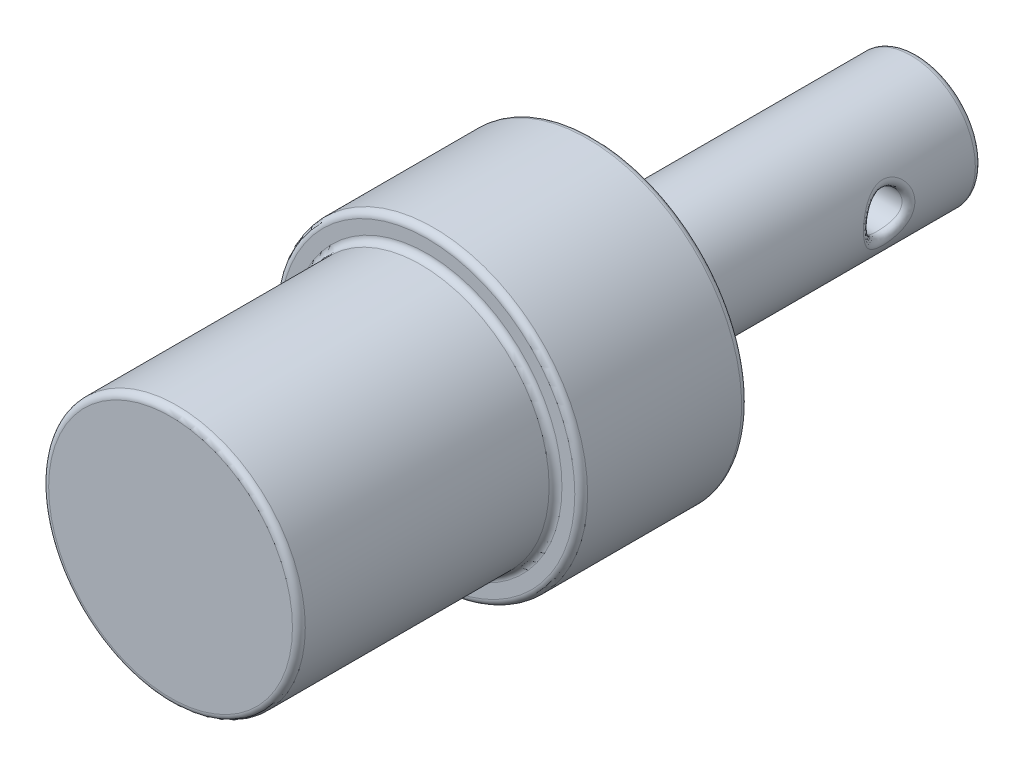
ISO-10303-21;
HEADER;
FILE_DESCRIPTION(('STEP AP214'),'2;1');
FILE_NAME('part.step','',(''),(''),'','','');
FILE_SCHEMA(('AUTOMOTIVE_DESIGN { 1 0 10303 214 1 1 1 1 }'));
ENDSEC;
DATA;
#1=APPLICATION_CONTEXT('core data for automotive mechanical design processes');
#2=APPLICATION_PROTOCOL_DEFINITION('international standard','automotive_design',2000,#1);
#3=PRODUCT_CONTEXT('',#1,'mechanical');
#4=PRODUCT('Part','Part','',(#3));
#5=PRODUCT_RELATED_PRODUCT_CATEGORY('part','',(#4));
#6=PRODUCT_DEFINITION_FORMATION('','',#4);
#7=PRODUCT_DEFINITION_CONTEXT('part definition',#1,'design');
#8=PRODUCT_DEFINITION('design','',#6,#7);
#9=PRODUCT_DEFINITION_SHAPE('','',#8);
#10=(LENGTH_UNIT() NAMED_UNIT(*) SI_UNIT(.MILLI.,.METRE.));
#11=(NAMED_UNIT(*) PLANE_ANGLE_UNIT() SI_UNIT($,.RADIAN.));
#12=(NAMED_UNIT(*) SI_UNIT($,.STERADIAN.) SOLID_ANGLE_UNIT());
#13=UNCERTAINTY_MEASURE_WITH_UNIT(LENGTH_MEASURE(1.E-05),#10,'distance_accuracy_value','');
#14=(GEOMETRIC_REPRESENTATION_CONTEXT(3) GLOBAL_UNCERTAINTY_ASSIGNED_CONTEXT((#13)) GLOBAL_UNIT_ASSIGNED_CONTEXT((#10,
#11,#12)) REPRESENTATION_CONTEXT('',''));
#15=CARTESIAN_POINT('',(0.,0.,0.));
#16=DIRECTION('',(0.,0.,1.));
#17=DIRECTION('',(1.,0.,0.));
#18=AXIS2_PLACEMENT_3D('',#15,#16,#17);
#19=CARTESIAN_POINT('',(0.,0.,-61.));
#20=DIRECTION('',(0.,0.,1.));
#21=DIRECTION('',(1.,0.,0.));
#22=AXIS2_PLACEMENT_3D('',#19,#20,#21);
#23=CONICAL_SURFACE('',#22,0.,1.02974425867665);
#24=CARTESIAN_POINT('',(0.,0.,-58.1413941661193));
#25=DIRECTION('',(0.,0.,-1.));
#26=DIRECTION('',(-1.,0.,0.));
#27=AXIS2_PLACEMENT_3D('',#24,#25,#26);
#28=CIRCLE('',#27,4.75751903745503);
#29=CARTESIAN_POINT('',(-4.75751903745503,0.,-58.1413941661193));
#30=VERTEX_POINT('',#29);
#31=EDGE_CURVE('E152',#30,#30,#28,.T.);
#32=ORIENTED_EDGE('',*,*,#31,.T.);
#33=EDGE_LOOP('',(#32));
#34=FACE_BOUND('',#33,.T.);
#35=CARTESIAN_POINT('',(0.,0.,-61.));
#36=VERTEX_POINT('',#35);
#37=VERTEX_LOOP('',#36);
#38=FACE_BOUND('',#37,.T.);
#39=ADVANCED_FACE('F31',(#34,#38),#23,.T.);
#40=CARTESIAN_POINT('',(0.,0.,0.));
#41=DIRECTION('',(0.,0.,1.));
#42=DIRECTION('',(1.,0.,0.));
#43=AXIS2_PLACEMENT_3D('',#40,#41,#42);
#44=PLANE('',#43);
#45=CARTESIAN_POINT('',(0.,0.,0.));
#46=DIRECTION('',(0.,0.,1.));
#47=DIRECTION('',(1.,0.,0.));
#48=AXIS2_PLACEMENT_3D('',#45,#46,#47);
#49=CIRCLE('',#48,9.49999999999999);
#50=CARTESIAN_POINT('',(9.49999999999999,0.,0.));
#51=VERTEX_POINT('',#50);
#52=EDGE_CURVE('E11',#51,#51,#49,.T.);
#53=ORIENTED_EDGE('',*,*,#52,.T.);
#54=EDGE_LOOP('',(#53));
#55=FACE_BOUND('',#54,.T.);
#56=ADVANCED_FACE('F48',(#55),#44,.T.);
#57=CARTESIAN_POINT('',(0.,0.,-61.));
#58=DIRECTION('',(0.,0.,-1.));
#59=DIRECTION('',(-1.,0.,0.));
#60=AXIS2_PLACEMENT_3D('',#57,#58,#59);
#61=CYLINDRICAL_SURFACE('',#60,9.99999999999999);
#62=CARTESIAN_POINT('',(0.,0.,-19.5));
#63=DIRECTION('',(0.,0.,1.));
#64=DIRECTION('',(1.,0.,0.));
#65=AXIS2_PLACEMENT_3D('',#62,#63,#64);
#66=CIRCLE('',#65,9.99999999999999);
#67=CARTESIAN_POINT('',(9.99999999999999,0.,-19.5));
#68=VERTEX_POINT('',#67);
#69=EDGE_CURVE('E43',#68,#68,#66,.T.);
#70=ORIENTED_EDGE('',*,*,#69,.T.);
#71=EDGE_LOOP('',(#70));
#72=FACE_BOUND('',#71,.T.);
#73=CARTESIAN_POINT('',(0.,0.,-0.5));
#74=DIRECTION('',(0.,0.,1.));
#75=DIRECTION('',(1.,0.,0.));
#76=AXIS2_PLACEMENT_3D('',#73,#74,#75);
#77=CIRCLE('',#76,9.99999999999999);
#78=CARTESIAN_POINT('',(9.99999999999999,0.,-0.5));
#79=VERTEX_POINT('',#78);
#80=EDGE_CURVE('E111',#79,#79,#77,.F.);
#81=ORIENTED_EDGE('',*,*,#80,.T.);
#82=EDGE_LOOP('',(#81));
#83=FACE_BOUND('',#82,.T.);
#84=ADVANCED_FACE('F54',(#72,#83),#61,.T.);
#85=CARTESIAN_POINT('',(0.,9.99999999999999,-20.));
#86=DIRECTION('',(0.,0.,1.));
#87=DIRECTION('',(1.,0.,0.));
#88=AXIS2_PLACEMENT_3D('',#85,#86,#87);
#89=PLANE('',#88);
#90=CARTESIAN_POINT('',(0.,0.,-20.));
#91=DIRECTION('',(0.,0.,1.));
#92=DIRECTION('',(1.,0.,0.));
#93=AXIS2_PLACEMENT_3D('',#90,#91,#92);
#94=CIRCLE('',#93,11.5);
#95=CARTESIAN_POINT('',(11.5,0.,-20.));
#96=VERTEX_POINT('',#95);
#97=EDGE_CURVE('E114',#96,#96,#94,.T.);
#98=ORIENTED_EDGE('',*,*,#97,.T.);
#99=EDGE_LOOP('',(#98));
#100=FACE_BOUND('',#99,.T.);
#101=CARTESIAN_POINT('',(0.,0.,-20.));
#102=DIRECTION('',(0.,0.,1.));
#103=DIRECTION('',(1.,0.,0.));
#104=AXIS2_PLACEMENT_3D('',#101,#102,#103);
#105=CIRCLE('',#104,10.5);
#106=CARTESIAN_POINT('',(10.5,0.,-20.));
#107=VERTEX_POINT('',#106);
#108=EDGE_CURVE('E117',#107,#107,#105,.F.);
#109=ORIENTED_EDGE('',*,*,#108,.T.);
#110=EDGE_LOOP('',(#109));
#111=FACE_BOUND('',#110,.T.);
#112=ADVANCED_FACE('F207',(#100,#111),#89,.T.);
#113=CARTESIAN_POINT('',(0.,0.,-61.));
#114=DIRECTION('',(0.,0.,-1.));
#115=DIRECTION('',(-1.,0.,0.));
#116=AXIS2_PLACEMENT_3D('',#113,#114,#115);
#117=CYLINDRICAL_SURFACE('',#116,12.);
#118=CARTESIAN_POINT('',(0.,0.,-32.5));
#119=DIRECTION('',(0.,0.,-1.));
#120=DIRECTION('',(-1.,0.,0.));
#121=AXIS2_PLACEMENT_3D('',#118,#119,#120);
#122=CIRCLE('',#121,12.);
#123=CARTESIAN_POINT('',(-12.,0.,-32.5));
#124=VERTEX_POINT('',#123);
#125=EDGE_CURVE('E120',#124,#124,#122,.F.);
#126=ORIENTED_EDGE('',*,*,#125,.T.);
#127=EDGE_LOOP('',(#126));
#128=FACE_BOUND('',#127,.T.);
#129=CARTESIAN_POINT('',(0.,0.,-20.5));
#130=DIRECTION('',(0.,0.,1.));
#131=DIRECTION('',(1.,0.,0.));
#132=AXIS2_PLACEMENT_3D('',#129,#130,#131);
#133=CIRCLE('',#132,12.);
#134=CARTESIAN_POINT('',(12.,0.,-20.5));
#135=VERTEX_POINT('',#134);
#136=EDGE_CURVE('E123',#135,#135,#133,.F.);
#137=ORIENTED_EDGE('',*,*,#136,.T.);
#138=EDGE_LOOP('',(#137));
#139=FACE_BOUND('',#138,.T.);
#140=ADVANCED_FACE('F182',(#128,#139),#117,.T.);
#141=CARTESIAN_POINT('',(0.,12.,-33.));
#142=DIRECTION('',(0.,0.,-1.));
#143=DIRECTION('',(-1.,0.,0.));
#144=AXIS2_PLACEMENT_3D('',#141,#142,#143);
#145=PLANE('',#144);
#146=CARTESIAN_POINT('',(0.,0.,-33.));
#147=DIRECTION('',(0.,0.,-1.));
#148=DIRECTION('',(-1.,0.,0.));
#149=AXIS2_PLACEMENT_3D('',#146,#147,#148);
#150=CIRCLE('',#149,5.5);
#151=CARTESIAN_POINT('',(-5.5,0.,-33.));
#152=VERTEX_POINT('',#151);
#153=EDGE_CURVE('E171',#152,#152,#150,.F.);
#154=ORIENTED_EDGE('',*,*,#153,.T.);
#155=EDGE_LOOP('',(#154));
#156=FACE_BOUND('',#155,.T.);
#157=CARTESIAN_POINT('',(0.,0.,-33.));
#158=DIRECTION('',(0.,0.,-1.));
#159=DIRECTION('',(-1.,0.,0.));
#160=AXIS2_PLACEMENT_3D('',#157,#158,#159);
#161=CIRCLE('',#160,11.5);
#162=CARTESIAN_POINT('',(-11.5,0.,-33.));
#163=VERTEX_POINT('',#162);
#164=EDGE_CURVE('E167',#163,#163,#161,.T.);
#165=ORIENTED_EDGE('',*,*,#164,.T.);
#166=EDGE_LOOP('',(#165));
#167=FACE_BOUND('',#166,.T.);
#168=ADVANCED_FACE('F86',(#156,#167),#145,.T.);
#169=CARTESIAN_POINT('',(0.,0.,-61.));
#170=DIRECTION('',(0.,0.,-1.));
#171=DIRECTION('',(-1.,0.,0.));
#172=AXIS2_PLACEMENT_3D('',#169,#170,#171);
#173=CYLINDRICAL_SURFACE('',#172,5.);
#174=CARTESIAN_POINT('',(0.,0.,-57.7128105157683));
#175=DIRECTION('',(0.,0.,1.));
#176=DIRECTION('',(1.,0.,0.));
#177=AXIS2_PLACEMENT_3D('',#174,#175,#176);
#178=CIRCLE('',#177,5.);
#179=CARTESIAN_POINT('',(5.,0.,-57.7128105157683));
#180=VERTEX_POINT('',#179);
#181=EDGE_CURVE('E150',#180,#180,#178,.T.);
#182=ORIENTED_EDGE('',*,*,#181,.T.);
#183=EDGE_LOOP('',(#182));
#184=FACE_BOUND('',#183,.T.);
#185=CARTESIAN_POINT('',(0.,0.,-33.5));
#186=DIRECTION('',(0.,0.,-1.));
#187=DIRECTION('',(-1.,0.,0.));
#188=AXIS2_PLACEMENT_3D('',#185,#186,#187);
#189=CIRCLE('',#188,5.);
#190=CARTESIAN_POINT('',(-5.,0.,-33.5));
#191=VERTEX_POINT('',#190);
#192=EDGE_CURVE('E161',#191,#191,#189,.T.);
#193=ORIENTED_EDGE('',*,*,#192,.T.);
#194=EDGE_LOOP('',(#193));
#195=FACE_BOUND('',#194,.T.);
#196=CARTESIAN_POINT('',(4.4992315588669,0.0623690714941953,-52.4987028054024));
#197=CARTESIAN_POINT('',(4.70641555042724,0.066191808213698,-52.4985437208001));
#198=CARTESIAN_POINT('',(4.85286046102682,0.0749886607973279,-52.64488697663));
#199=CARTESIAN_POINT('',(4.9993053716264,0.0837855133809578,-52.79123023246));
#200=CARTESIAN_POINT('',(4.99914617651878,0.0923986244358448,-52.9982704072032));
#201=CARTESIAN_POINT('',(4.50118130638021,-0.0166627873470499,-52.5019937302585));
#202=CARTESIAN_POINT('',(4.70816919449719,-0.0176539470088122,-52.5022379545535));
#203=CARTESIAN_POINT('',(4.85461864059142,-0.0200259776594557,-52.6488438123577));
#204=CARTESIAN_POINT('',(5.00106763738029,-0.0223572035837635,-52.795448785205));
#205=CARTESIAN_POINT('',(5.00131256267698,-0.0246856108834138,-53.0026583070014));
#206=CARTESIAN_POINT('',(4.49939924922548,-0.0959957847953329,-52.4990085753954));
#207=CARTESIAN_POINT('',(4.70656141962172,-0.101969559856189,-52.4988750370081));
#208=CARTESIAN_POINT('',(4.8530094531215,-0.11544874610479,-52.6452497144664));
#209=CARTESIAN_POINT('',(4.9994517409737,-0.129035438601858,-52.7916116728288));
#210=CARTESIAN_POINT('',(4.99933249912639,-0.142215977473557,-52.9986781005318));
#211=CARTESIAN_POINT('',(4.48856905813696,-0.252916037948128,-52.4806324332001));
#212=CARTESIAN_POINT('',(4.69682831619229,-0.268247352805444,-52.478270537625));
#213=CARTESIAN_POINT('',(4.84325261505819,-0.303940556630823,-52.6231761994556));
#214=CARTESIAN_POINT('',(4.98967168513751,-0.339738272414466,-52.7680697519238));
#215=CARTESIAN_POINT('',(4.98729895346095,-0.374690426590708,-52.9741765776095));
#216=CARTESIAN_POINT('',(4.47952135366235,-0.330503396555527,-52.4652421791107));
#217=CARTESIAN_POINT('',(4.68868865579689,-0.35033302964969,-52.4609985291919));
#218=CARTESIAN_POINT('',(4.83510535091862,-0.39700973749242,-52.604697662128));
#219=CARTESIAN_POINT('',(4.98149312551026,-0.443919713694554,-52.7483301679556));
#220=CARTESIAN_POINT('',(4.97724594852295,-0.489634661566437,-52.9536562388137));
#221=CARTESIAN_POINT('',(4.45529425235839,-0.480424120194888,-52.4230788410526));
#222=CARTESIAN_POINT('',(4.6670111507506,-0.508009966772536,-52.4140066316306));
#223=CARTESIAN_POINT('',(4.81337920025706,-0.576272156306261,-52.5542825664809));
#224=CARTESIAN_POINT('',(4.9597207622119,-0.644758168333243,-52.6944965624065));
#225=CARTESIAN_POINT('',(4.95032694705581,-0.711739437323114,-52.8974384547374));
#226=CARTESIAN_POINT('',(4.44022591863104,-0.552826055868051,-52.396511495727));
#227=CARTESIAN_POINT('',(4.65354250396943,-0.583785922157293,-52.3844479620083));
#228=CARTESIAN_POINT('',(4.79989873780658,-0.662557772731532,-52.5225893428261));
#229=CARTESIAN_POINT('',(4.94619636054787,-0.741639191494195,-52.6605886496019));
#230=CARTESIAN_POINT('',(4.93358435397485,-0.819001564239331,-52.8620153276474));
#231=CARTESIAN_POINT('',(4.40535589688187,-0.692192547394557,-52.3329442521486));
#232=CARTESIAN_POINT('',(4.622587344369,-0.728396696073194,-52.3143637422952));
#233=CARTESIAN_POINT('',(4.76888810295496,-0.827814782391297,-52.4472131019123));
#234=CARTESIAN_POINT('',(4.91513106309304,-0.927543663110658,-52.579921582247));
#235=CARTESIAN_POINT('',(4.8948398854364,-1.0254704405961,-52.7772590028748));
#236=CARTESIAN_POINT('',(4.38555304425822,-0.759155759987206,-52.2959417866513));
#237=CARTESIAN_POINT('',(4.60506762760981,-0.797283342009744,-52.2737555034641));
#238=CARTESIAN_POINT('',(4.75135693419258,-0.906784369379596,-52.4035271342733));
#239=CARTESIAN_POINT('',(4.8975569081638,-1.01663801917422,-52.5330663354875));
#240=CARTESIAN_POINT('',(4.87283671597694,-1.12467520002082,-52.7279223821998));
#241=CARTESIAN_POINT('',(4.34153538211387,-0.890496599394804,-52.2097860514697));
#242=CARTESIAN_POINT('',(4.56645183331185,-0.930856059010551,-52.1802870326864));
#243=CARTESIAN_POINT('',(4.71270166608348,-1.06057397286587,-52.3026449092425));
#244=CARTESIAN_POINT('',(4.85885163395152,-1.19069218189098,-52.4247413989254));
#245=CARTESIAN_POINT('',(4.82392820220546,-1.31925422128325,-52.6130480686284));
#246=CARTESIAN_POINT('',(4.31711650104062,-0.95441728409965,-52.1599954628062));
#247=CARTESIAN_POINT('',(4.54517212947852,-0.994963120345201,-52.1267188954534));
#248=CARTESIAN_POINT('',(4.69141740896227,-1.13478301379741,-52.2447509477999));
#249=CARTESIAN_POINT('',(4.83753849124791,-1.27499561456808,-52.3624208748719));
#250=CARTESIAN_POINT('',(4.79679611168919,-1.41395153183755,-52.5466606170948));
#251=CARTESIAN_POINT('',(4.26718543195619,-1.07332535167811,-52.0509454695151));
#252=CARTESIAN_POINT('',(4.50214439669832,-1.11234518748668,-52.0112265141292));
#253=CARTESIAN_POINT('',(4.64837960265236,-1.27144145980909,-52.1194227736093));
#254=CARTESIAN_POINT('',(4.7944901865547,-1.43093511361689,-52.2272565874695));
#255=CARTESIAN_POINT('',(4.7413171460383,-1.59011163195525,-52.4012606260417));
#256=CARTESIAN_POINT('',(4.24167289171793,-1.12830982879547,-51.991682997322));
#257=CARTESIAN_POINT('',(4.48038350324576,-1.16558088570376,-51.949224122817));
#258=CARTESIAN_POINT('',(4.62662590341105,-1.33388704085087,-52.0519854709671));
#259=CARTESIAN_POINT('',(4.77274243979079,-1.50252954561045,-52.1543167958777));
#260=CARTESIAN_POINT('',(4.71296987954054,-1.67157011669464,-52.3222439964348));
#261=CARTESIAN_POINT('',(4.19036138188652,-1.23160802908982,-51.8605635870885));
#262=CARTESIAN_POINT('',(4.43717432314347,-1.26372890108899,-51.8145814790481));
#263=CARTESIAN_POINT('',(4.58346716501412,-1.44973800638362,-51.9049327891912));
#264=CARTESIAN_POINT('',(4.72961678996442,-1.63613316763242,-51.9947973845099));
#265=CARTESIAN_POINT('',(4.65595709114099,-1.82460448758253,-52.1474181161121));
#266=CARTESIAN_POINT('',(4.16466082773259,-1.27921423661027,-51.788124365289));
#267=CARTESIAN_POINT('',(4.41587204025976,-1.30772006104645,-51.7414970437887));
#268=CARTESIAN_POINT('',(4.56218634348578,-1.5022403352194,-51.8248012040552));
#269=CARTESIAN_POINT('',(4.70838908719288,-1.69702354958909,-51.9076112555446));
#270=CARTESIAN_POINT('',(4.6274009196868,-1.89513220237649,-52.0508324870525));
#271=CARTESIAN_POINT('',(4.11801794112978,-1.3615135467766,-51.6354474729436));
#272=CARTESIAN_POINT('',(4.37776033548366,-1.38214941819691,-51.5908794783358));
#273=CARTESIAN_POINT('',(4.52417230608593,-1.59167420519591,-51.6589010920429));
#274=CARTESIAN_POINT('',(4.67046929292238,-1.80146902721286,-51.7264281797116));
#275=CARTESIAN_POINT('',(4.57557549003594,-2.01705710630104,-51.847263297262));
#276=CARTESIAN_POINT('',(4.09707406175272,-1.39621084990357,-51.555212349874));
#277=CARTESIAN_POINT('',(4.36099461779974,-1.41247519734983,-51.5133933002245));
#278=CARTESIAN_POINT('',(4.50743761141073,-1.6286108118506,-51.573134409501));
#279=CARTESIAN_POINT('',(4.65382105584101,-1.84487590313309,-51.6324794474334));
#280=CARTESIAN_POINT('',(4.55230451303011,-2.06846051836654,-51.7402831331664));
#281=CARTESIAN_POINT('',(4.06346717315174,-1.45038917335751,-51.3918236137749));
#282=CARTESIAN_POINT('',(4.33438181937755,-1.45902075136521,-51.3587762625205));
#283=CARTESIAN_POINT('',(4.48093488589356,-1.68557558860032,-51.4013689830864));
#284=CARTESIAN_POINT('',(4.6274284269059,-1.91225693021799,-51.4435857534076));
#285=CARTESIAN_POINT('',(4.51496352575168,-2.14872470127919,-51.5224314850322));
#286=CARTESIAN_POINT('',(4.05055186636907,-1.4703379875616,-51.3088558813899));
#287=CARTESIAN_POINT('',(4.3243723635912,-1.47558163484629,-51.2818367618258));
#288=CARTESIAN_POINT('',(4.47095361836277,-1.70612536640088,-51.3154728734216));
#289=CARTESIAN_POINT('',(4.61752179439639,-1.93669675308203,-51.3489153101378));
#290=CARTESIAN_POINT('',(4.50061318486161,-2.17827850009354,-51.4118078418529));
#291=CARTESIAN_POINT('',(4.03391358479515,-1.49585448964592,-51.1402568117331));
#292=CARTESIAN_POINT('',(4.31149945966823,-1.49668060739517,-51.1271701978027));
#293=CARTESIAN_POINT('',(4.45815115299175,-1.73230062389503,-51.1425784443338));
#294=CARTESIAN_POINT('',(4.60478657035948,-1.96795300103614,-51.1577839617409));
#295=CARTESIAN_POINT('',(4.48212620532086,-2.21608072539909,-51.1870090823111));
#296=CARTESIAN_POINT('',(4.03018278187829,-1.50143442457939,-51.0546278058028));
#297=CARTESIAN_POINT('',(4.3086623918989,-1.50117501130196,-51.0496352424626));
#298=CARTESIAN_POINT('',(4.45532385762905,-1.73793881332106,-51.0555811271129));
#299=CARTESIAN_POINT('',(4.60198408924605,-1.97470498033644,-51.0615592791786));
#300=CARTESIAN_POINT('',(4.4779808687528,-2.22434729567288,-51.0728370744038));
#301=CARTESIAN_POINT('',(4.03238235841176,-1.49810122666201,-50.8919771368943));
#302=CARTESIAN_POINT('',(4.31035391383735,-1.49844689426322,-50.9019053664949));
#303=CARTESIAN_POINT('',(4.45700483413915,-1.73454285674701,-50.8901091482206));
#304=CARTESIAN_POINT('',(4.60365638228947,-1.97063766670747,-50.8783317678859));
#305=CARTESIAN_POINT('',(4.4804248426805,-2.21940922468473,-50.8559695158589));
#306=CARTESIAN_POINT('',(4.03742117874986,-1.49052570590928,-50.8149169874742));
#307=CARTESIAN_POINT('',(4.31419932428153,-1.49231135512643,-50.8318858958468));
#308=CARTESIAN_POINT('',(4.46083611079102,-1.72686296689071,-50.8116166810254));
#309=CARTESIAN_POINT('',(4.60745617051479,-1.96144832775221,-50.7915357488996));
#310=CARTESIAN_POINT('',(4.48602353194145,-2.20818623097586,-50.7532226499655));
#311=CARTESIAN_POINT('',(4.05479514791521,-1.46375417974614,-50.6633260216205));
#312=CARTESIAN_POINT('',(4.32767216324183,-1.47008824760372,-50.6923487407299));
#313=CARTESIAN_POINT('',(4.47423782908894,-1.6993307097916,-50.6557406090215));
#314=CARTESIAN_POINT('',(4.6207882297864,-1.92860514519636,-50.6193162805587));
#315=CARTESIAN_POINT('',(4.50532794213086,-2.16852471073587,-50.5511013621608));
#316=CARTESIAN_POINT('',(4.0671315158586,-1.44455623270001,-50.5887956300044));
#317=CARTESIAN_POINT('',(4.3372735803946,-1.45404450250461,-50.622966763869));
#318=CARTESIAN_POINT('',(4.48380922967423,-1.67947630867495,-50.5783571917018));
#319=CARTESIAN_POINT('',(4.63029473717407,-1.90501552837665,-50.5340586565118));
#320=CARTESIAN_POINT('',(4.51903501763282,-2.14008330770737,-50.4517275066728));
#321=CARTESIAN_POINT('',(4.0975839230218,-1.39530287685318,-50.4441468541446));
#322=CARTESIAN_POINT('',(4.36142098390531,-1.41163560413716,-50.4858272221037));
#323=CARTESIAN_POINT('',(4.50785710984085,-1.62761775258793,-50.4260736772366));
#324=CARTESIAN_POINT('',(4.65424561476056,-1.84370330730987,-50.3666281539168));
#325=CARTESIAN_POINT('',(4.55287102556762,-2.06711537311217,-50.2588624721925));
#326=CARTESIAN_POINT('',(4.1157005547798,-1.36524635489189,-50.3740289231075));
#327=CARTESIAN_POINT('',(4.37593038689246,-1.38534116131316,-50.4181602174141));
#328=CARTESIAN_POINT('',(4.52233409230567,-1.59561235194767,-50.3511738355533));
#329=CARTESIAN_POINT('',(4.66865356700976,-1.80607981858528,-50.284561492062));
#330=CARTESIAN_POINT('',(4.57300061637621,-2.02258719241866,-50.1653718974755));
#331=CARTESIAN_POINT('',(4.15574917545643,-1.29520560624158,-50.2396106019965));
#332=CARTESIAN_POINT('',(4.40856865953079,-1.32226790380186,-50.2860032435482));
#333=CARTESIAN_POINT('',(4.55488519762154,-1.51970701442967,-50.2055056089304));
#334=CARTESIAN_POINT('',(4.70111873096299,-1.71733982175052,-50.1253823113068));
#335=CARTESIAN_POINT('',(4.61749908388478,-1.91882312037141,-49.9861474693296));
#336=CARTESIAN_POINT('',(4.17768263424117,-1.25521755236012,-50.1753124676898));
#337=CARTESIAN_POINT('',(4.42666768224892,-1.28556326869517,-50.2215498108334));
#338=CARTESIAN_POINT('',(4.57296070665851,-1.47580249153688,-50.1347388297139));
#339=CARTESIAN_POINT('',(4.71914602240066,-1.66632173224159,-50.0483084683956));
#340=CARTESIAN_POINT('',(4.6418695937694,-1.85958155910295,-49.9004166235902));
#341=CARTESIAN_POINT('',(4.2254449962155,-1.16200358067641,-50.0478664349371));
#342=CARTESIAN_POINT('',(4.46663804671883,-1.1978808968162,-50.0917515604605));
#343=CARTESIAN_POINT('',(4.61288983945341,-1.37189957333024,-49.9926821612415));
#344=CARTESIAN_POINT('',(4.75901509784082,-1.54624779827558,-49.8940657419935));
#345=CARTESIAN_POINT('',(4.6949388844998,-1.7214867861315,-49.7304885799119));
#346=CARTESIAN_POINT('',(4.25144597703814,-1.10788013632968,-49.9854100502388));
#347=CARTESIAN_POINT('',(4.48869737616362,-1.14593487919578,-50.0268490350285));
#348=CARTESIAN_POINT('',(4.63493930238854,-1.31076736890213,-49.9219831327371));
#349=CARTESIAN_POINT('',(4.78104918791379,-1.47600574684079,-49.8175118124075));
#350=CARTESIAN_POINT('',(4.72382886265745,-1.6413039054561,-49.6472134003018));
#351=CARTESIAN_POINT('',(4.30281979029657,-0.990047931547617,-49.8701324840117));
#352=CARTESIAN_POINT('',(4.53278132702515,-1.03042651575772,-49.9054502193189));
#353=CARTESIAN_POINT('',(4.6790244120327,-1.175944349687,-49.7900832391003));
#354=CARTESIAN_POINT('',(4.82513491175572,-1.32186559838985,-49.6751134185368));
#355=CARTESIAN_POINT('',(4.78091087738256,-1.46673767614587,-49.4935099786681));
#356=CARTESIAN_POINT('',(4.32819255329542,-0.926338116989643,-49.8173123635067));
#357=CARTESIAN_POINT('',(4.55481453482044,-0.966910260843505,-49.8488815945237));
#358=CARTESIAN_POINT('',(4.70106005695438,-1.10225215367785,-49.7288834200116));
#359=CARTESIAN_POINT('',(4.84719482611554,-1.23801819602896,-49.609179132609));
#360=CARTESIAN_POINT('',(4.80910283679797,-1.37235276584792,-49.4230831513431));
#361=CARTESIAN_POINT('',(4.37692779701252,-0.78735831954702,-49.720318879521));
#362=CARTESIAN_POINT('',(4.59743988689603,-0.826258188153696,-49.7440772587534));
#363=CARTESIAN_POINT('',(4.74373432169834,-0.939988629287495,-49.6156408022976));
#364=CARTESIAN_POINT('',(4.8899067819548,-1.05417970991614,-49.4875280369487));
#365=CARTESIAN_POINT('',(4.8632531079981,-1.16645676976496,-49.2937585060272));
#366=CARTESIAN_POINT('',(4.40013513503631,-0.711680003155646,-49.6766828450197));
#367=CARTESIAN_POINT('',(4.61795260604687,-0.748589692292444,-49.696244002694));
#368=CARTESIAN_POINT('',(4.76425496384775,-0.850872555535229,-49.5641791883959));
#369=CARTESIAN_POINT('',(4.91048079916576,-0.95356409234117,-49.4323019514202));
#370=CARTESIAN_POINT('',(4.88903903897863,-1.05434074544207,-49.235577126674));
#371=CARTESIAN_POINT('',(4.44046314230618,-0.553092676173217,-49.6029587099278));
#372=CARTESIAN_POINT('',(4.65373447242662,-0.584168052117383,-49.6150161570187));
#373=CARTESIAN_POINT('',(4.80010096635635,-0.662918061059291,-49.4768030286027));
#374=CARTESIAN_POINT('',(4.9463881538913,-0.742076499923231,-49.338782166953));
#375=CARTESIAN_POINT('',(4.93384793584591,-0.819396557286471,-49.1372782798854));
#376=CARTESIAN_POINT('',(4.45758379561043,-0.470183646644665,-49.5728706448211));
#377=CARTESIAN_POINT('',(4.66905164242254,-0.497337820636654,-49.5815015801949));
#378=CARTESIAN_POINT('',(4.81542631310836,-0.564079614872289,-49.4408885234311));
#379=CARTESIAN_POINT('',(4.96176959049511,-0.631099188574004,-49.3003489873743));
#380=CARTESIAN_POINT('',(4.9528708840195,-0.696568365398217,-49.0971608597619));
#381=CARTESIAN_POINT('',(4.48292399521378,-0.304665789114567,-49.5289171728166));
#382=CARTESIAN_POINT('',(4.69174043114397,-0.323073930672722,-49.5324702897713));
#383=CARTESIAN_POINT('',(4.83816428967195,-0.366051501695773,-49.3883010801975));
#384=CARTESIAN_POINT('',(4.98455899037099,-0.409278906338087,-49.244198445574));
#385=CARTESIAN_POINT('',(4.9810266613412,-0.451356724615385,-49.0385562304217));
#386=CARTESIAN_POINT('',(4.4916032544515,-0.222319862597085,-49.5142101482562));
#387=CARTESIAN_POINT('',(4.69955545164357,-0.235860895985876,-49.5159466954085));
#388=CARTESIAN_POINT('',(4.84598522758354,-0.267216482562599,-49.3706306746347));
#389=CARTESIAN_POINT('',(4.99241189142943,-0.29866366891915,-49.2253218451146));
#390=CARTESIAN_POINT('',(4.99067028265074,-0.329362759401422,-49.0189468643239));
#391=CARTESIAN_POINT('',(4.50073068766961,-0.0562227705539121,-49.4987488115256));
#392=CARTESIAN_POINT('',(4.70776007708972,-0.0597565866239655,-49.4986049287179));
#393=CARTESIAN_POINT('',(4.85421054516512,-0.0676296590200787,-49.3520529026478));
#394=CARTESIAN_POINT('',(5.00065633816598,-0.0756001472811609,-49.2055112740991));
#395=CARTESIAN_POINT('',(5.00081187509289,-0.083292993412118,-48.9983317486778));
#396=CARTESIAN_POINT('',(4.50120197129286,0.0275237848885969,-49.4979553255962));
#397=CARTESIAN_POINT('',(4.70818446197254,0.0292765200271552,-49.4977132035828));
#398=CARTESIAN_POINT('',(4.85463574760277,0.0331159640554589,-49.3510984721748));
#399=CARTESIAN_POINT('',(5.00108283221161,0.0370288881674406,-49.2044932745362));
#400=CARTESIAN_POINT('',(5.00133552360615,0.0407759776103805,-48.9972737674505));
#401=CARTESIAN_POINT('',(4.49620620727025,0.142208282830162,-49.5064144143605));
#402=CARTESIAN_POINT('',(4.70369526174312,0.150893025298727,-49.5071980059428));
#403=CARTESIAN_POINT('',(4.85013337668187,0.170957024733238,-49.3612633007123));
#404=CARTESIAN_POINT('',(4.9965718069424,0.191032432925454,-49.215327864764));
#405=CARTESIAN_POINT('',(4.99578467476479,0.210678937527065,-49.0085525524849));
#406=CARTESIAN_POINT('',(4.49423003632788,0.173787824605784,-49.509759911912));
#407=CARTESIAN_POINT('',(4.70191802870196,0.184374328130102,-49.5109522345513));
#408=CARTESIAN_POINT('',(4.84835230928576,0.208899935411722,-49.3652835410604));
#409=CARTESIAN_POINT('',(4.99478592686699,0.233446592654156,-49.2196162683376));
#410=CARTESIAN_POINT('',(4.99358892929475,0.257463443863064,-49.013013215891));
#411=CARTESIAN_POINT('',(4.4850571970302,0.286554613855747,-49.5253474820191));
#412=CARTESIAN_POINT('',(4.6936718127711,0.303839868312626,-49.5284336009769));
#413=CARTESIAN_POINT('',(4.84009080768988,0.344302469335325,-49.3840022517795));
#414=CARTESIAN_POINT('',(4.98650014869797,0.384896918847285,-49.2395929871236));
#415=CARTESIAN_POINT('',(4.98339688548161,0.424525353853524,-49.0337966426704));
#416=CARTESIAN_POINT('',(4.47455322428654,0.36690988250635,-49.5432817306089));
#417=CARTESIAN_POINT('',(4.68422798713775,0.388759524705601,-49.5485435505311));
#418=CARTESIAN_POINT('',(4.83063867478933,0.44062421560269,-49.4055208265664));
#419=CARTESIAN_POINT('',(4.97701182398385,0.492761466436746,-49.262585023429));
#420=CARTESIAN_POINT('',(4.97172580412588,0.543570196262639,-49.0577089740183));
#421=CARTESIAN_POINT('',(4.44685826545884,0.523165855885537,-49.5917984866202));
#422=CARTESIAN_POINT('',(4.65947547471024,0.552790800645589,-49.6025332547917));
#423=CARTESIAN_POINT('',(4.80583217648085,0.627242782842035,-49.4634640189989));
#424=CARTESIAN_POINT('',(4.95215388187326,0.701967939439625,-49.3244772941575));
#425=CARTESIAN_POINT('',(4.94095362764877,0.775060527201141,-49.1223979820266));
#426=CARTESIAN_POINT('',(4.42964835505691,0.59905324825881,-49.6224168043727));
#427=CARTESIAN_POINT('',(4.64411498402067,0.631986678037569,-49.6365316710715));
#428=CARTESIAN_POINT('',(4.79046110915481,0.717521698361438,-49.4999308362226));
#429=CARTESIAN_POINT('',(4.93673228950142,0.803422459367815,-49.3635142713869));
#430=CARTESIAN_POINT('',(4.9218315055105,0.887486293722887,-49.1632224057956));
#431=CARTESIAN_POINT('',(4.39040308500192,0.743989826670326,-49.6950031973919));
#432=CARTESIAN_POINT('',(4.6093620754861,0.781748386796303,-49.7162906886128));
#433=CARTESIAN_POINT('',(4.75564989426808,0.888938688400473,-49.5857793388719));
#434=CARTESIAN_POINT('',(4.90186459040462,0.996492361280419,-49.455448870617));
#435=CARTESIAN_POINT('',(4.87822565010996,1.1022071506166,-49.2600042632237));
#436=CARTESIAN_POINT('',(4.36838854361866,0.813066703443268,-49.7369224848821));
#437=CARTESIAN_POINT('',(4.58994910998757,0.852402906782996,-49.7620984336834));
#438=CARTESIAN_POINT('',(4.73622731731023,0.970113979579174,-49.6351054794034));
#439=CARTESIAN_POINT('',(4.88239786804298,1.08822207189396,-49.5084008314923));
#440=CARTESIAN_POINT('',(4.85376504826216,1.20454326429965,-49.3158966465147));
#441=CARTESIAN_POINT('',(4.32161444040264,0.943254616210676,-49.8309312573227));
#442=CARTESIAN_POINT('',(4.54910006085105,0.983816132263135,-49.8634687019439));
#443=CARTESIAN_POINT('',(4.69533991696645,1.12185402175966,-49.7446768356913));
#444=CARTESIAN_POINT('',(4.84147267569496,1.26029189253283,-49.6261721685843));
#445=CARTESIAN_POINT('',(4.80179382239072,1.397414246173,-49.4412416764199));
#446=CARTESIAN_POINT('',(4.29685562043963,1.00436779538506,-49.8830179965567));
#447=CARTESIAN_POINT('',(4.52763762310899,1.044577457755,-49.9191203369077));
#448=CARTESIAN_POINT('',(4.67387564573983,1.19242162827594,-49.8049191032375));
#449=CARTESIAN_POINT('',(4.81998797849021,1.34064328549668,-49.6910977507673));
#450=CARTESIAN_POINT('',(4.77428402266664,1.48795228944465,-49.5106906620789));
#451=CARTESIAN_POINT('',(4.24547185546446,1.12074928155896,-49.9994602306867));
#452=CARTESIAN_POINT('',(4.48360467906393,1.15839601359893,-50.0415179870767));
#453=CARTESIAN_POINT('',(4.62985228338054,1.32537240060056,-49.9379398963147));
#454=CARTESIAN_POINT('',(4.7759601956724,1.49277288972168,-49.8347837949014));
#455=CARTESIAN_POINT('',(4.71719095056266,1.66036930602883,-49.6659469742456));
#456=CARTESIAN_POINT('',(4.21882153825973,1.17547852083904,-50.0643494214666));
#457=CARTESIAN_POINT('',(4.46104223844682,1.21073473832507,-50.108770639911));
#458=CARTESIAN_POINT('',(4.60730130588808,1.38705046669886,-50.0112404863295));
#459=CARTESIAN_POINT('',(4.75342844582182,1.56370456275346,-49.91419254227));
#460=CARTESIAN_POINT('',(4.68757948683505,1.74144966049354,-49.7524658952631));
#461=CARTESIAN_POINT('',(4.1679645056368,1.27345464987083,-50.2028129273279));
#462=CARTESIAN_POINT('',(4.41858442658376,1.30252103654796,-50.2493296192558));
#463=CARTESIAN_POINT('',(4.56490408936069,1.49595764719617,-50.1651480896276));
#464=CARTESIAN_POINT('',(4.71108993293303,1.68973852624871,-50.0814490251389));
#465=CARTESIAN_POINT('',(4.63107167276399,1.88659948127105,-49.9370839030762));
#466=CARTESIAN_POINT('',(4.14375849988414,1.31669821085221,-50.2763897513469));
#467=CARTESIAN_POINT('',(4.39871383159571,1.34186801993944,-50.3226521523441));
#468=CARTESIAN_POINT('',(4.54505863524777,1.54318257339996,-50.2457572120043));
#469=CARTESIAN_POINT('',(4.69130830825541,1.74471504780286,-50.169324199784));
#470=CARTESIAN_POINT('',(4.60417611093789,1.95066401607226,-50.0351863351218));
#471=CARTESIAN_POINT('',(4.10054545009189,1.39073458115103,-50.4313995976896));
#472=CARTESIAN_POINT('',(4.36371914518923,1.40784991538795,-50.4737687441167));
#473=CARTESIAN_POINT('',(4.51017083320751,1.6228807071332,-50.4126081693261));
#474=CARTESIAN_POINT('',(4.6565223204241,1.83813978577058,-50.351919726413));
#475=CARTESIAN_POINT('',(4.55616161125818,2.06034752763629,-50.2418661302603));
#476=CARTESIAN_POINT('',(4.08159585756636,1.42139143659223,-50.5129072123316));
#477=CARTESIAN_POINT('',(4.34869778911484,1.43422966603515,-50.5515269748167));
#478=CARTESIAN_POINT('',(4.49518128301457,1.65519328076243,-50.4989003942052));
#479=CARTESIAN_POINT('',(4.64162104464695,1.87625073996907,-50.4466203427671));
#480=CARTESIAN_POINT('',(4.53510650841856,2.10576509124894,-50.3505429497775));
#481=CARTESIAN_POINT('',(4.05202814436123,1.46821758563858,-50.680767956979));
#482=CARTESIAN_POINT('',(4.32546095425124,1.47395701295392,-50.7087542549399));
#483=CARTESIAN_POINT('',(4.47205231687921,1.70402863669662,-50.6739188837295));
#484=CARTESIAN_POINT('',(4.61859500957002,1.93420151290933,-50.6394361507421));
#485=CARTESIAN_POINT('',(4.50225349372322,2.17513716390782,-50.57435727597));
#486=CARTESIAN_POINT('',(4.0414015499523,1.4844016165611,-50.7671160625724));
#487=CARTESIAN_POINT('',(4.31729048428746,1.48722349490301,-50.788061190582));
#488=CARTESIAN_POINT('',(4.46390593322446,1.72056748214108,-50.7626425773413));
#489=CARTESIAN_POINT('',(4.61051494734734,1.95392521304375,-50.7373564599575));
#490=CARTESIAN_POINT('',(4.49044616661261,2.19911350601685,-50.6894880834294));
#491=CARTESIAN_POINT('',(4.03071387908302,1.50065069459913,-50.9336749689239));
#492=CARTESIAN_POINT('',(4.30906100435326,1.50055513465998,-50.9399619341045));
#493=CARTESIAN_POINT('',(4.45572206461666,1.73715477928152,-50.9326561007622));
#494=CARTESIAN_POINT('',(4.60237743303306,1.97376532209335,-50.925469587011));
#495=CARTESIAN_POINT('',(4.47857097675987,2.22318621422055,-50.9115666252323));
#496=CARTESIAN_POINT('',(4.02977551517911,1.5020543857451,-51.0137249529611));
#497=CARTESIAN_POINT('',(4.30834732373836,1.50168608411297,-51.0123425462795));
#498=CARTESIAN_POINT('',(4.45501119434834,1.73857287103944,-51.0138838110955));
#499=CARTESIAN_POINT('',(4.60167247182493,1.97546449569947,-51.0153479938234));
#500=CARTESIAN_POINT('',(4.47752835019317,2.22526575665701,-51.0182999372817));
#501=CARTESIAN_POINT('',(4.03631837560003,1.49213962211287,-51.172828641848));
#502=CARTESIAN_POINT('',(4.31337659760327,1.49357503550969,-51.1570772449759));
#503=CARTESIAN_POINT('',(4.46001156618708,1.72847129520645,-51.1759519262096));
#504=CARTESIAN_POINT('',(4.60664458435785,1.963371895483,-51.1947564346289));
#505=CARTESIAN_POINT('',(4.48479819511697,2.21057721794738,-51.2304381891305));
#506=CARTESIAN_POINT('',(4.04379884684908,1.48082230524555,-51.2518824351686));
#507=CARTESIAN_POINT('',(4.31910723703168,1.48435285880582,-51.2292621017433));
#508=CARTESIAN_POINT('',(4.46572223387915,1.71695278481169,-51.256792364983));
#509=CARTESIAN_POINT('',(4.61230948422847,1.94960969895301,-51.2840770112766));
#510=CARTESIAN_POINT('',(4.49310982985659,2.1938108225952,-51.3358432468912));
#511=CARTESIAN_POINT('',(4.0656054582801,1.44682697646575,-51.4030087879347));
#512=CARTESIAN_POINT('',(4.33611758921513,1.45585965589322,-51.3694464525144));
#513=CARTESIAN_POINT('',(4.48264631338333,1.68177627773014,-51.4131389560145));
#514=CARTESIAN_POINT('',(4.62915234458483,1.90774071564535,-51.4566116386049));
#515=CARTESIAN_POINT('',(4.51733939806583,2.14344737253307,-51.53734505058));
#516=CARTESIAN_POINT('',(4.07959748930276,1.42470106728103,-51.4752350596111));
#517=CARTESIAN_POINT('',(4.34709513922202,1.4371309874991,-51.4373540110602));
#518=CARTESIAN_POINT('',(4.4935918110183,1.65870699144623,-51.4887184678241));
#519=CARTESIAN_POINT('',(4.64003022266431,1.88041063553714,-51.5397584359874));
#520=CARTESIAN_POINT('',(4.5328860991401,2.11066824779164,-51.6336467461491));
#521=CARTESIAN_POINT('',(4.11265968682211,1.37018601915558,-51.6149971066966));
#522=CARTESIAN_POINT('',(4.37351156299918,1.38960402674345,-51.5712075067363));
#523=CARTESIAN_POINT('',(4.51991034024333,1.60084645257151,-51.6370485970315));
#524=CARTESIAN_POINT('',(4.6662524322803,1.8122139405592,-51.7025663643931));
#525=CARTESIAN_POINT('',(4.56962187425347,2.02990521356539,-51.819996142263));
#526=CARTESIAN_POINT('',(4.13173136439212,1.33779382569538,-51.6825314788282));
#527=CARTESIAN_POINT('',(4.3889166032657,1.36087488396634,-51.6370815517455));
#528=CARTESIAN_POINT('',(4.53528468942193,1.56605171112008,-51.709798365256));
#529=CARTESIAN_POINT('',(4.6815630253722,1.7714428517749,-51.7821445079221));
#530=CARTESIAN_POINT('',(4.59081262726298,1.98191677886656,-51.9100419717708));
#531=CARTESIAN_POINT('',(4.17457467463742,1.26085550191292,-51.8164858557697));
#532=CARTESIAN_POINT('',(4.42408964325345,1.29074653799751,-51.7700730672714));
#533=CARTESIAN_POINT('',(4.57038375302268,1.4820099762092,-51.8561140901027));
#534=CARTESIAN_POINT('',(4.7165768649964,1.67351587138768,-51.9417303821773));
#535=CARTESIAN_POINT('',(4.63841630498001,1.86793407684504,-52.088647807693));
#536=CARTESIAN_POINT('',(4.19859156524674,1.21557987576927,-51.8824421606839));
#537=CARTESIAN_POINT('',(4.44407409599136,1.24863150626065,-51.8369171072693));
#538=CARTESIAN_POINT('',(4.59034830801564,1.43187458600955,-51.929331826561));
#539=CARTESIAN_POINT('',(4.73649912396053,1.61545400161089,-52.0213339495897));
#540=CARTESIAN_POINT('',(4.66510173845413,1.80085907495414,-52.1765895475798));
#541=CARTESIAN_POINT('',(4.24779136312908,1.11529360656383,-52.0062157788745));
#542=CARTESIAN_POINT('',(4.48558774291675,1.1530214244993,-51.9643608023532));
#543=CARTESIAN_POINT('',(4.63182646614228,1.31914271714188,-52.0684647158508));
#544=CARTESIAN_POINT('',(4.7779419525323,1.48559799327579,-52.1721539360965));
#545=CARTESIAN_POINT('',(4.71976818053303,1.65228682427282,-52.3416210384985));
#546=CARTESIAN_POINT('',(4.2729746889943,1.06027944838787,-52.0640301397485));
#547=CARTESIAN_POINT('',(4.50710758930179,1.09959134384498,-52.0249927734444));
#548=CARTESIAN_POINT('',(4.65334062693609,1.25654173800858,-52.1343772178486));
#549=CARTESIAN_POINT('',(4.79945287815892,1.41388252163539,-52.2434141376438));
#550=CARTESIAN_POINT('',(4.74774965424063,1.57078436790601,-52.4187068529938));
#551=CARTESIAN_POINT('',(4.32408980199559,0.936823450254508,-52.1746347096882));
#552=CARTESIAN_POINT('',(4.55121051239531,0.977449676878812,-52.1423351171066));
#553=CARTESIAN_POINT('',(4.6974669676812,1.11443766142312,-52.2616873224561));
#554=CARTESIAN_POINT('',(4.84358359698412,1.25187442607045,-52.3806350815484));
#555=CARTESIAN_POINT('',(4.80454422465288,1.38788659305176,-52.5661796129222));
#556=CARTESIAN_POINT('',(4.34991926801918,0.867658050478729,-52.2266485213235));
#557=CARTESIAN_POINT('',(4.57376781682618,0.907863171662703,-52.1984591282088));
#558=CARTESIAN_POINT('',(4.72002856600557,1.03398090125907,-52.3222971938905));
#559=CARTESIAN_POINT('',(4.86618105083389,1.16055110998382,-52.4458553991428));
#560=CARTESIAN_POINT('',(4.83324363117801,1.28541933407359,-52.6355313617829));
#561=CARTESIAN_POINT('',(4.39732387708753,0.720808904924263,-52.3183019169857));
#562=CARTESIAN_POINT('',(4.61543321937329,0.758024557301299,-52.2981518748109));
#563=CARTESIAN_POINT('',(4.76174767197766,0.861660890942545,-52.4298479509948));
#564=CARTESIAN_POINT('',(4.90795181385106,0.965747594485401,-52.5612604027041));
#565=CARTESIAN_POINT('',(4.88591541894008,1.06786504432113,-52.7577358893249));
#566=CARTESIAN_POINT('',(4.4188997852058,0.643126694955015,-52.3579437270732));
#567=CARTESIAN_POINT('',(4.63458277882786,0.677747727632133,-52.3418430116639));
#568=CARTESIAN_POINT('',(4.78090579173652,0.769799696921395,-52.4767912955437));
#569=CARTESIAN_POINT('',(4.92716650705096,0.862226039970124,-52.6115894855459));
#570=CARTESIAN_POINT('',(4.90988865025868,0.952780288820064,-52.8105916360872));
#571=CARTESIAN_POINT('',(4.45488743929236,0.48334951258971,-52.4225340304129));
#572=CARTESIAN_POINT('',(4.6666159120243,0.511201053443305,-52.4133171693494));
#573=CARTESIAN_POINT('',(4.81299970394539,0.579810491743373,-52.5535952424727));
#574=CARTESIAN_POINT('',(4.95932237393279,0.648776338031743,-52.6937280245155));
#575=CARTESIAN_POINT('',(4.94987493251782,0.71607335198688,-52.8967120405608));
#576=CARTESIAN_POINT('',(4.46946872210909,0.401418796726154,-52.447833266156));
#577=CARTESIAN_POINT('',(4.67969035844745,0.425055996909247,-52.4415818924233));
#578=CARTESIAN_POINT('',(4.82608246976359,0.481903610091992,-52.5838630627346));
#579=CARTESIAN_POINT('',(4.97245467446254,0.53897121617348,-52.7260979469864));
#580=CARTESIAN_POINT('',(4.96607635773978,0.594694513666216,-52.9304443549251));
#581=CARTESIAN_POINT('',(4.49057805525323,0.233898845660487,-52.4841236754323));
#582=CARTESIAN_POINT('',(4.69861795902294,0.248228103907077,-52.4821457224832));
#583=CARTESIAN_POINT('',(4.84505455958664,0.281152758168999,-52.6273519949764));
#584=CARTESIAN_POINT('',(4.99146918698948,0.314300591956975,-52.7725085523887));
#585=CARTESIAN_POINT('',(4.98953117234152,0.346516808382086,-52.9788315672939));
#586=CARTESIAN_POINT('',(4.49711131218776,0.148312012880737,-52.4951240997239));
#587=CARTESIAN_POINT('',(4.70450775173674,0.157408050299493,-52.494524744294));
#588=CARTESIAN_POINT('',(4.850948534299,0.17831202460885,-52.6405841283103));
#589=CARTESIAN_POINT('',(4.9973881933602,0.199258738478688,-52.7866408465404));
#590=CARTESIAN_POINT('',(4.99679034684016,0.219721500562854,-52.9934987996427));
#591=CARTESIAN_POINT('',(4.4992315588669,0.0623690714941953,-52.4987028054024));
#592=CARTESIAN_POINT('',(4.70641555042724,0.066191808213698,-52.4985437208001));
#593=CARTESIAN_POINT('',(4.85286046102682,0.0749886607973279,-52.64488697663));
#594=CARTESIAN_POINT('',(4.9993053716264,0.0837855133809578,-52.79123023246));
#595=CARTESIAN_POINT('',(4.99914617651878,0.0923986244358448,-52.9982704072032));
#596=(BOUNDED_SURFACE() B_SPLINE_SURFACE(3,2,((#196,#197,#198,#199,#200),(#201,#202,#203,#204,
#205),(#206,#207,#208,#209,#210),(#211,#212,#213,#214,#215),(#216,#217,#218,#219,#220),(#221,
#222,#223,#224,#225),(#226,#227,#228,#229,#230),(#231,#232,#233,#234,#235),(#236,#237,#238,#239,
#240),(#241,#242,#243,#244,#245),(#246,#247,#248,#249,#250),(#251,#252,#253,#254,#255),(#256,
#257,#258,#259,#260),(#261,#262,#263,#264,#265),(#266,#267,#268,#269,#270),(#271,#272,#273,#274,
#275),(#276,#277,#278,#279,#280),(#281,#282,#283,#284,#285),(#286,#287,#288,#289,#290),(#291,
#292,#293,#294,#295),(#296,#297,#298,#299,#300),(#301,#302,#303,#304,#305),(#306,#307,#308,#309,
#310),(#311,#312,#313,#314,#315),(#316,#317,#318,#319,#320),(#321,#322,#323,#324,#325),(#326,
#327,#328,#329,#330),(#331,#332,#333,#334,#335),(#336,#337,#338,#339,#340),(#341,#342,#343,#344,
#345),(#346,#347,#348,#349,#350),(#351,#352,#353,#354,#355),(#356,#357,#358,#359,#360),(#361,
#362,#363,#364,#365),(#366,#367,#368,#369,#370),(#371,#372,#373,#374,#375),(#376,#377,#378,#379,
#380),(#381,#382,#383,#384,#385),(#386,#387,#388,#389,#390),(#391,#392,#393,#394,#395),(#396,
#397,#398,#399,#400),(#401,#402,#403,#404,#405),(#406,#407,#408,#409,#410),(#411,#412,#413,#414,
#415),(#416,#417,#418,#419,#420),(#421,#422,#423,#424,#425),(#426,#427,#428,#429,#430),(#431,
#432,#433,#434,#435),(#436,#437,#438,#439,#440),(#441,#442,#443,#444,#445),(#446,#447,#448,#449,
#450),(#451,#452,#453,#454,#455),(#456,#457,#458,#459,#460),(#461,#462,#463,#464,#465),(#466,
#467,#468,#469,#470),(#471,#472,#473,#474,#475),(#476,#477,#478,#479,#480),(#481,#482,#483,#484,
#485),(#486,#487,#488,#489,#490),(#491,#492,#493,#494,#495),(#496,#497,#498,#499,#500),(#501,
#502,#503,#504,#505),(#506,#507,#508,#509,#510),(#511,#512,#513,#514,#515),(#516,#517,#518,#519,
#520),(#521,#522,#523,#524,#525),(#526,#527,#528,#529,#530),(#531,#532,#533,#534,#535),(#536,
#537,#538,#539,#540),(#541,#542,#543,#544,#545),(#546,#547,#548,#549,#550),(#551,#552,#553,#554,
#555),(#556,#557,#558,#559,#560),(#561,#562,#563,#564,#565),(#566,#567,#568,#569,#570),(#571,
#572,#573,#574,#575),(#576,#577,#578,#579,#580),(#581,#582,#583,#584,#585),(#586,#587,#588,#589,
#590),(#591,#592,#593,#594,#595)),.UNSPECIFIED.,.T.,.F.,.F.) B_SPLINE_SURFACE_WITH_KNOTS((4,2,2,
2,2,2,2,2,2,2,2,2,2,2,2,2,2,2,2,2,2,2,2,2,2,2,2,2,2,2,2,2,2,2,2,2,2,2,2,4),(3,2,3),(0.,
0.316035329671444,0.632051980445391,0.942489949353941,1.25300435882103,1.58386558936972,
1.91483419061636,2.26830061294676,2.62165191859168,2.96324847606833,3.30455378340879,
3.61315220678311,3.92180219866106,4.23048384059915,4.53928462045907,4.87746650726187,
5.21568560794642,5.57015369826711,5.92462271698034,6.25847906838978,6.59139529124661,
6.71850821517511,7.04740997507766,7.37724670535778,7.70568167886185,8.03402808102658,
8.38127816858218,8.72862878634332,9.07963837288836,9.43029012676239,9.74887713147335,
10.0674356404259,10.3711976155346,10.6750500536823,11.001697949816,11.3284639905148,
11.6814731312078,12.034418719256,12.3783129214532,12.7219845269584),(0.,0.5,1.),
.UNSPECIFIED.) GEOMETRIC_REPRESENTATION_ITEM() RATIONAL_B_SPLINE_SURFACE(((1.,0.923806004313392,
1.,0.923806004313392,1.),(1.,0.923992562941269,1.,0.923992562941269,1.),(1.,0.923822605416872,
1.,0.923822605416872,1.),(1.,0.922784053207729,1.,0.922784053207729,1.),(1.,0.921915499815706,
1.,0.921915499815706,1.),(1.,0.919567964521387,1.,0.919567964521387,1.),(1.,0.918100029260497,
1.,0.918100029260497,1.),(1.,0.914660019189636,1.,0.914660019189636,1.),(1.,0.912687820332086,
1.,0.912687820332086,1.),(1.,0.908235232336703,1.,0.908235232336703,1.),(1.,0.905730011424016,
1.,0.905730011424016,1.),(1.,0.900508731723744,1.,0.900508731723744,1.),(1.,0.89779260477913,1.,
0.89779260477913,1.),(1.,0.892218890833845,1.,0.892218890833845,1.),(1.,0.88936423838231,1.,
0.88936423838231,1.),(1.,0.884080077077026,1.,0.884080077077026,1.),(1.,0.881650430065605,1.,
0.881650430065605,1.),(1.,0.877697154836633,1.,0.877697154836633,1.),(1.,0.876146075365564,1.,
0.876146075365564,1.),(1.,0.874139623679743,1.,0.874139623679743,1.),(1.,0.873683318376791,1.,
0.873683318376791,1.),(1.,0.873950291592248,1.,0.873950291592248,1.),(1.,0.87456472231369,1.,
0.87456472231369,1.),(1.,0.876654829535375,1.,0.876654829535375,1.),(1.,0.878130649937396,1.,
0.878130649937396,1.),(1.,0.881707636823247,1.,0.881707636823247,1.),(1.,0.883808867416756,1.,
0.883808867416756,1.),(1.,0.888361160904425,1.,0.888361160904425,1.),(1.,0.890812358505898,1.,
0.890812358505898,1.),(1.,0.896045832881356,1.,0.896045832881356,1.),(1.,0.898837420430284,1.,
0.898837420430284,1.),(1.,0.90424907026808,1.,0.90424907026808,1.),(1.,0.906869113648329,1.,
0.906869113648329,1.),(1.,0.911825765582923,1.,0.911825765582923,1.),(1.,0.914142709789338,1.,
0.914142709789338,1.),(1.,0.918125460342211,1.,0.918125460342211,1.),(1.,0.919791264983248,1.,
0.919791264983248,1.),(1.,0.922243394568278,1.,0.922243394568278,1.),(1.,0.923075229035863,1.,
0.923075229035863,1.),(1.,0.923949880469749,1.,0.923949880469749,1.),(1.,0.923994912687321,1.,
0.923994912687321,1.),(1.,0.923516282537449,1.,0.923516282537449,1.),(1.,0.923326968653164,1.,
0.923326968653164,1.),(1.,0.922446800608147,1.,0.922446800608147,1.),(1.,0.921436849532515,1.,
0.921436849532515,1.),(1.,0.918746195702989,1.,0.918746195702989,1.),(1.,0.917063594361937,1.,
0.917063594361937,1.),(1.,0.913171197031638,1.,0.913171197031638,1.),(1.,0.910963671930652,1.,
0.910963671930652,1.),(1.,0.906191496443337,1.,0.906191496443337,1.),(1.,0.903626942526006,1.,
0.903626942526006,1.),(1.,0.898200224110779,1.,0.898200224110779,1.),(1.,0.895329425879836,1.,
0.895329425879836,1.),(1.,0.889735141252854,1.,0.889735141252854,1.),(1.,0.887011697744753,1.,
0.887011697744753,1.),(1.,0.882060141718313,1.,0.882060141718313,1.),(1.,0.879837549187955,1.,
0.879837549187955,1.),(1.,0.876329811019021,1.,0.876329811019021,1.),(1.,0.875043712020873,1.,
0.875043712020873,1.),(1.,0.873748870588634,1.,0.873748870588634,1.),(1.,0.873634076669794,1.,
0.873634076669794,1.),(1.,0.874428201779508,1.,0.874428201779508,1.),(1.,0.875337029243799,1.,
0.875337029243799,1.),(1.,0.877944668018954,1.,0.877944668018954,1.),(1.,0.879604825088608,1.,
0.879604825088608,1.),(1.,0.88345477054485,1.,0.88345477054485,1.),(1.,0.885644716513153,1.,
0.885644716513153,1.),(1.,0.890467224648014,1.,0.890467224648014,1.),(1.,0.89312066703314,1.,
0.89312066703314,1.),(1.,0.898447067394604,1.,0.898447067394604,1.),(1.,0.901120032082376,1.,
0.901120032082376,1.),(1.,0.906451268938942,1.,0.906451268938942,1.),(1.,0.909091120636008,1.,
0.909091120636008,1.),(1.,0.913866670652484,1.,0.913866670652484,1.),(1.,0.916002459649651,1.,
0.916002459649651,1.),(1.,0.919531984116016,1.,0.919531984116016,1.),(1.,0.920943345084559,1.,
0.920943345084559,1.),(1.,0.922978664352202,1.,0.922978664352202,1.),(1.,0.923603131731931,1.,
0.923603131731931,1.),(1.,0.923806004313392,1.,0.923806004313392,1.))) REPRESENTATION_ITEM('') SURFACE());
#597=CARTESIAN_POINT('',(4.99914617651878,0.0923986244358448,-52.9982704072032));
#598=CARTESIAN_POINT('',(5.00131256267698,-0.0246856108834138,-53.0026583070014));
#599=CARTESIAN_POINT('',(4.99933249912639,-0.142215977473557,-52.9986781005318));
#600=CARTESIAN_POINT('',(4.98729895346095,-0.374690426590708,-52.9741765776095));
#601=CARTESIAN_POINT('',(4.97724594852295,-0.489634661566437,-52.9536562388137));
#602=CARTESIAN_POINT('',(4.95032694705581,-0.711739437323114,-52.8974384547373));
#603=CARTESIAN_POINT('',(4.93358435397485,-0.819001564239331,-52.8620153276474));
#604=CARTESIAN_POINT('',(4.8948398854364,-1.0254704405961,-52.7772590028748));
#605=CARTESIAN_POINT('',(4.87283671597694,-1.12467520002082,-52.7279223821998));
#606=CARTESIAN_POINT('',(4.82392820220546,-1.31925422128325,-52.6130480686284));
#607=CARTESIAN_POINT('',(4.79679611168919,-1.41395153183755,-52.5466606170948));
#608=CARTESIAN_POINT('',(4.7413171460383,-1.59011163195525,-52.4012606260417));
#609=CARTESIAN_POINT('',(4.71296987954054,-1.67157011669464,-52.3222439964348));
#610=CARTESIAN_POINT('',(4.65595709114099,-1.82460448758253,-52.1474181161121));
#611=CARTESIAN_POINT('',(4.6274009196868,-1.89513220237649,-52.0508324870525));
#612=CARTESIAN_POINT('',(4.57557549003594,-2.01705710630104,-51.847263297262));
#613=CARTESIAN_POINT('',(4.55230451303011,-2.06846051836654,-51.7402831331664));
#614=CARTESIAN_POINT('',(4.51496352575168,-2.14872470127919,-51.5224314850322));
#615=CARTESIAN_POINT('',(4.50061318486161,-2.17827850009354,-51.4118078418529));
#616=CARTESIAN_POINT('',(4.48212620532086,-2.21608072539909,-51.1870090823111));
#617=CARTESIAN_POINT('',(4.4779808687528,-2.22434729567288,-51.0728370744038));
#618=CARTESIAN_POINT('',(4.4804248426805,-2.21940922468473,-50.8559695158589));
#619=CARTESIAN_POINT('',(4.48602353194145,-2.20818623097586,-50.7532226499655));
#620=CARTESIAN_POINT('',(4.50532794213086,-2.16852471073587,-50.5511013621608));
#621=CARTESIAN_POINT('',(4.51903501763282,-2.14008330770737,-50.4517275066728));
#622=CARTESIAN_POINT('',(4.55287102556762,-2.06711537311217,-50.2588624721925));
#623=CARTESIAN_POINT('',(4.5730006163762,-2.02258719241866,-50.1653718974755));
#624=CARTESIAN_POINT('',(4.61749908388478,-1.91882312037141,-49.9861474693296));
#625=CARTESIAN_POINT('',(4.6418695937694,-1.85958155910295,-49.9004166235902));
#626=CARTESIAN_POINT('',(4.6949388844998,-1.7214867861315,-49.7304885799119));
#627=CARTESIAN_POINT('',(4.72382886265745,-1.6413039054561,-49.6472134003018));
#628=CARTESIAN_POINT('',(4.78091087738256,-1.46673767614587,-49.4935099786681));
#629=CARTESIAN_POINT('',(4.80910283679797,-1.37235276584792,-49.4230831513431));
#630=CARTESIAN_POINT('',(4.8632531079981,-1.16645676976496,-49.2937585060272));
#631=CARTESIAN_POINT('',(4.88903903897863,-1.05434074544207,-49.235577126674));
#632=CARTESIAN_POINT('',(4.93384793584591,-0.819396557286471,-49.1372782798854));
#633=CARTESIAN_POINT('',(4.9528708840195,-0.696568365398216,-49.0971608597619));
#634=CARTESIAN_POINT('',(4.9810266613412,-0.451356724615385,-49.0385562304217));
#635=CARTESIAN_POINT('',(4.99067028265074,-0.329362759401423,-49.0189468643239));
#636=CARTESIAN_POINT('',(5.00081187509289,-0.0832929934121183,-48.9983317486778));
#637=CARTESIAN_POINT('',(5.00133552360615,0.0407759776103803,-48.9972737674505));
#638=CARTESIAN_POINT('',(4.99578467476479,0.210678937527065,-49.0085525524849));
#639=CARTESIAN_POINT('',(4.99358892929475,0.257463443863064,-49.013013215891));
#640=CARTESIAN_POINT('',(4.98339688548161,0.424525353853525,-49.0337966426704));
#641=CARTESIAN_POINT('',(4.97172580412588,0.543570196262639,-49.0577089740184));
#642=CARTESIAN_POINT('',(4.94095362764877,0.775060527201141,-49.1223979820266));
#643=CARTESIAN_POINT('',(4.9218315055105,0.887486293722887,-49.1632224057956));
#644=CARTESIAN_POINT('',(4.87822565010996,1.1022071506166,-49.2600042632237));
#645=CARTESIAN_POINT('',(4.85376504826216,1.20454326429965,-49.3158966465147));
#646=CARTESIAN_POINT('',(4.80179382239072,1.397414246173,-49.4412416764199));
#647=CARTESIAN_POINT('',(4.77428402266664,1.48795228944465,-49.5106906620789));
#648=CARTESIAN_POINT('',(4.71719095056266,1.66036930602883,-49.6659469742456));
#649=CARTESIAN_POINT('',(4.68757948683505,1.74144966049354,-49.7524658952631));
#650=CARTESIAN_POINT('',(4.63107167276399,1.88659948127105,-49.9370839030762));
#651=CARTESIAN_POINT('',(4.60417611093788,1.95066401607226,-50.0351863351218));
#652=CARTESIAN_POINT('',(4.55616161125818,2.06034752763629,-50.2418661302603));
#653=CARTESIAN_POINT('',(4.53510650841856,2.10576509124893,-50.3505429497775));
#654=CARTESIAN_POINT('',(4.50225349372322,2.17513716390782,-50.57435727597));
#655=CARTESIAN_POINT('',(4.49044616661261,2.19911350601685,-50.6894880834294));
#656=CARTESIAN_POINT('',(4.47857097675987,2.22318621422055,-50.9115666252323));
#657=CARTESIAN_POINT('',(4.47752835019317,2.22526575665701,-51.0182999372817));
#658=CARTESIAN_POINT('',(4.48479819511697,2.21057721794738,-51.2304381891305));
#659=CARTESIAN_POINT('',(4.49310982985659,2.1938108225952,-51.3358432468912));
#660=CARTESIAN_POINT('',(4.51733939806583,2.14344737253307,-51.53734505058));
#661=CARTESIAN_POINT('',(4.5328860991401,2.11066824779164,-51.6336467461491));
#662=CARTESIAN_POINT('',(4.56962187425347,2.02990521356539,-51.819996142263));
#663=CARTESIAN_POINT('',(4.59081262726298,1.98191677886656,-51.9100419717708));
#664=CARTESIAN_POINT('',(4.63841630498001,1.86793407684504,-52.088647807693));
#665=CARTESIAN_POINT('',(4.66510173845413,1.80085907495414,-52.1765895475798));
#666=CARTESIAN_POINT('',(4.71976818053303,1.65228682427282,-52.3416210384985));
#667=CARTESIAN_POINT('',(4.74774965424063,1.57078436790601,-52.4187068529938));
#668=CARTESIAN_POINT('',(4.80454422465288,1.38788659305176,-52.5661796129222));
#669=CARTESIAN_POINT('',(4.83324363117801,1.28541933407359,-52.6355313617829));
#670=CARTESIAN_POINT('',(4.88591541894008,1.06786504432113,-52.7577358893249));
#671=CARTESIAN_POINT('',(4.90988865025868,0.952780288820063,-52.8105916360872));
#672=CARTESIAN_POINT('',(4.94987493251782,0.71607335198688,-52.8967120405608));
#673=CARTESIAN_POINT('',(4.96607635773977,0.594694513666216,-52.9304443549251));
#674=CARTESIAN_POINT('',(4.98953117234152,0.346516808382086,-52.9788315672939));
#675=CARTESIAN_POINT('',(4.99679034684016,0.219721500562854,-52.9934987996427));
#676=CARTESIAN_POINT('',(4.99914617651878,0.0923986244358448,-52.9982704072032));
#677=B_SPLINE_CURVE_WITH_KNOTS('',3,(#597,#598,#599,#600,#601,#602,#603,#604,#605,#606,#607,
#608,#609,#610,#611,#612,#613,#614,#615,#616,#617,#618,#619,#620,#621,#622,#623,#624,#625,#626,
#627,#628,#629,#630,#631,#632,#633,#634,#635,#636,#637,#638,#639,#640,#641,#642,#643,#644,#645,
#646,#647,#648,#649,#650,#651,#652,#653,#654,#655,#656,#657,#658,#659,#660,#661,#662,#663,#664,
#665,#666,#667,#668,#669,#670,#671,#672,#673,#674,#675,#676),.UNSPECIFIED.,.T.,.F.,(4,2,2,2,2,2,
2,2,2,2,2,2,2,2,2,2,2,2,2,2,2,2,2,2,2,2,2,2,2,2,2,2,2,2,2,2,2,2,2,4),(0.,0.316035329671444,
0.632051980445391,0.942489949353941,1.25300435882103,1.58386558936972,1.91483419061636,
2.26830061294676,2.62165191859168,2.96324847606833,3.30455378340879,3.61315220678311,
3.92180219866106,4.23048384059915,4.53928462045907,4.87746650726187,5.21568560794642,
5.57015369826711,5.92462271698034,6.25847906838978,6.59139529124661,6.71850821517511,
7.04740997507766,7.37724670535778,7.70568167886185,8.03402808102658,8.38127816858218,
8.72862878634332,9.07963837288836,9.43029012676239,9.74887713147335,10.0674356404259,
10.3711976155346,10.6750500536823,11.001697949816,11.3284639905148,11.6814731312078,
12.034418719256,12.3783129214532,12.7219845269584),.UNSPECIFIED.);
#678=CARTESIAN_POINT('',(4.99914617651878,0.0923986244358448,-52.9982704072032));
#679=VERTEX_POINT('',#678);
#680=EDGE_CURVE('E92',#679,#679,#677,.T.);
#681=ORIENTED_EDGE('',*,*,#680,.T.);
#682=EDGE_LOOP('',(#681));
#683=FACE_BOUND('',#682,.T.);
#684=CARTESIAN_POINT('',(-4.4992315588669,-0.0623690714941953,-52.4987028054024));
#685=CARTESIAN_POINT('',(-4.70641555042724,-0.066191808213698,-52.4985437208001));
#686=CARTESIAN_POINT('',(-4.85286046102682,-0.0749886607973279,-52.64488697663));
#687=CARTESIAN_POINT('',(-4.9993053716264,-0.0837855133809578,-52.79123023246));
#688=CARTESIAN_POINT('',(-4.99914617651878,-0.0923986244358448,-52.9982704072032));
#689=CARTESIAN_POINT('',(-4.50118130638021,0.0166627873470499,-52.5019937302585));
#690=CARTESIAN_POINT('',(-4.70816919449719,0.0176539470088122,-52.5022379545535));
#691=CARTESIAN_POINT('',(-4.85461864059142,0.0200259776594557,-52.6488438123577));
#692=CARTESIAN_POINT('',(-5.00106763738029,0.0223572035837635,-52.795448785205));
#693=CARTESIAN_POINT('',(-5.00131256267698,0.0246856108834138,-53.0026583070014));
#694=CARTESIAN_POINT('',(-4.49939924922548,0.0959957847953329,-52.4990085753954));
#695=CARTESIAN_POINT('',(-4.70656141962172,0.101969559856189,-52.4988750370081));
#696=CARTESIAN_POINT('',(-4.8530094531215,0.11544874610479,-52.6452497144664));
#697=CARTESIAN_POINT('',(-4.9994517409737,0.129035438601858,-52.7916116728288));
#698=CARTESIAN_POINT('',(-4.99933249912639,0.142215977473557,-52.9986781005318));
#699=CARTESIAN_POINT('',(-4.48856905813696,0.252916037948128,-52.4806324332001));
#700=CARTESIAN_POINT('',(-4.69682831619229,0.268247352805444,-52.478270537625));
#701=CARTESIAN_POINT('',(-4.84325261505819,0.303940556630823,-52.6231761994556));
#702=CARTESIAN_POINT('',(-4.98967168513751,0.339738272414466,-52.7680697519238));
#703=CARTESIAN_POINT('',(-4.98729895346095,0.374690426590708,-52.9741765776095));
#704=CARTESIAN_POINT('',(-4.47952135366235,0.330503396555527,-52.4652421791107));
#705=CARTESIAN_POINT('',(-4.68868865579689,0.35033302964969,-52.4609985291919));
#706=CARTESIAN_POINT('',(-4.83510535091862,0.39700973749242,-52.604697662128));
#707=CARTESIAN_POINT('',(-4.98149312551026,0.443919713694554,-52.7483301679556));
#708=CARTESIAN_POINT('',(-4.97724594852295,0.489634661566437,-52.9536562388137));
#709=CARTESIAN_POINT('',(-4.45529425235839,0.480424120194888,-52.4230788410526));
#710=CARTESIAN_POINT('',(-4.6670111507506,0.508009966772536,-52.4140066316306));
#711=CARTESIAN_POINT('',(-4.81337920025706,0.576272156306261,-52.5542825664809));
#712=CARTESIAN_POINT('',(-4.9597207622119,0.644758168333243,-52.6944965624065));
#713=CARTESIAN_POINT('',(-4.95032694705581,0.711739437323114,-52.8974384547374));
#714=CARTESIAN_POINT('',(-4.44022591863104,0.552826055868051,-52.396511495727));
#715=CARTESIAN_POINT('',(-4.65354250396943,0.583785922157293,-52.3844479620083));
#716=CARTESIAN_POINT('',(-4.79989873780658,0.662557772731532,-52.5225893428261));
#717=CARTESIAN_POINT('',(-4.94619636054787,0.741639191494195,-52.6605886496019));
#718=CARTESIAN_POINT('',(-4.93358435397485,0.819001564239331,-52.8620153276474));
#719=CARTESIAN_POINT('',(-4.40535589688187,0.692192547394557,-52.3329442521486));
#720=CARTESIAN_POINT('',(-4.622587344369,0.728396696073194,-52.3143637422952));
#721=CARTESIAN_POINT('',(-4.76888810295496,0.827814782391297,-52.4472131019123));
#722=CARTESIAN_POINT('',(-4.91513106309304,0.927543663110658,-52.579921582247));
#723=CARTESIAN_POINT('',(-4.8948398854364,1.0254704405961,-52.7772590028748));
#724=CARTESIAN_POINT('',(-4.38555304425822,0.759155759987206,-52.2959417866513));
#725=CARTESIAN_POINT('',(-4.60506762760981,0.797283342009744,-52.2737555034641));
#726=CARTESIAN_POINT('',(-4.75135693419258,0.906784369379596,-52.4035271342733));
#727=CARTESIAN_POINT('',(-4.8975569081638,1.01663801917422,-52.5330663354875));
#728=CARTESIAN_POINT('',(-4.87283671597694,1.12467520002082,-52.7279223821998));
#729=CARTESIAN_POINT('',(-4.34153538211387,0.890496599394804,-52.2097860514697));
#730=CARTESIAN_POINT('',(-4.56645183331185,0.930856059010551,-52.1802870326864));
#731=CARTESIAN_POINT('',(-4.71270166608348,1.06057397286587,-52.3026449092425));
#732=CARTESIAN_POINT('',(-4.85885163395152,1.19069218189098,-52.4247413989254));
#733=CARTESIAN_POINT('',(-4.82392820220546,1.31925422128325,-52.6130480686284));
#734=CARTESIAN_POINT('',(-4.31711650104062,0.95441728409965,-52.1599954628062));
#735=CARTESIAN_POINT('',(-4.54517212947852,0.994963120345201,-52.1267188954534));
#736=CARTESIAN_POINT('',(-4.69141740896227,1.13478301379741,-52.2447509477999));
#737=CARTESIAN_POINT('',(-4.83753849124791,1.27499561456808,-52.3624208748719));
#738=CARTESIAN_POINT('',(-4.79679611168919,1.41395153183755,-52.5466606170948));
#739=CARTESIAN_POINT('',(-4.26718543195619,1.07332535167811,-52.0509454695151));
#740=CARTESIAN_POINT('',(-4.50214439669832,1.11234518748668,-52.0112265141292));
#741=CARTESIAN_POINT('',(-4.64837960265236,1.27144145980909,-52.1194227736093));
#742=CARTESIAN_POINT('',(-4.7944901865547,1.43093511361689,-52.2272565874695));
#743=CARTESIAN_POINT('',(-4.7413171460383,1.59011163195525,-52.4012606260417));
#744=CARTESIAN_POINT('',(-4.24167289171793,1.12830982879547,-51.991682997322));
#745=CARTESIAN_POINT('',(-4.48038350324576,1.16558088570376,-51.949224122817));
#746=CARTESIAN_POINT('',(-4.62662590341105,1.33388704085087,-52.0519854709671));
#747=CARTESIAN_POINT('',(-4.77274243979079,1.50252954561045,-52.1543167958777));
#748=CARTESIAN_POINT('',(-4.71296987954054,1.67157011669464,-52.3222439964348));
#749=CARTESIAN_POINT('',(-4.19036138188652,1.23160802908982,-51.8605635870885));
#750=CARTESIAN_POINT('',(-4.43717432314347,1.26372890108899,-51.8145814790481));
#751=CARTESIAN_POINT('',(-4.58346716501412,1.44973800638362,-51.9049327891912));
#752=CARTESIAN_POINT('',(-4.72961678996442,1.63613316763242,-51.9947973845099));
#753=CARTESIAN_POINT('',(-4.65595709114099,1.82460448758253,-52.1474181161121));
#754=CARTESIAN_POINT('',(-4.16466082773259,1.27921423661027,-51.788124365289));
#755=CARTESIAN_POINT('',(-4.41587204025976,1.30772006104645,-51.7414970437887));
#756=CARTESIAN_POINT('',(-4.56218634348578,1.5022403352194,-51.8248012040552));
#757=CARTESIAN_POINT('',(-4.70838908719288,1.69702354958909,-51.9076112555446));
#758=CARTESIAN_POINT('',(-4.6274009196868,1.89513220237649,-52.0508324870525));
#759=CARTESIAN_POINT('',(-4.11801794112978,1.3615135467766,-51.6354474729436));
#760=CARTESIAN_POINT('',(-4.37776033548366,1.38214941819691,-51.5908794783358));
#761=CARTESIAN_POINT('',(-4.52417230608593,1.59167420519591,-51.6589010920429));
#762=CARTESIAN_POINT('',(-4.67046929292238,1.80146902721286,-51.7264281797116));
#763=CARTESIAN_POINT('',(-4.57557549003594,2.01705710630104,-51.847263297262));
#764=CARTESIAN_POINT('',(-4.09707406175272,1.39621084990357,-51.555212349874));
#765=CARTESIAN_POINT('',(-4.36099461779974,1.41247519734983,-51.5133933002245));
#766=CARTESIAN_POINT('',(-4.50743761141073,1.6286108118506,-51.573134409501));
#767=CARTESIAN_POINT('',(-4.65382105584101,1.84487590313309,-51.6324794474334));
#768=CARTESIAN_POINT('',(-4.55230451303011,2.06846051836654,-51.7402831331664));
#769=CARTESIAN_POINT('',(-4.06346717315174,1.45038917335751,-51.3918236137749));
#770=CARTESIAN_POINT('',(-4.33438181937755,1.45902075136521,-51.3587762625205));
#771=CARTESIAN_POINT('',(-4.48093488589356,1.68557558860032,-51.4013689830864));
#772=CARTESIAN_POINT('',(-4.6274284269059,1.91225693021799,-51.4435857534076));
#773=CARTESIAN_POINT('',(-4.51496352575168,2.14872470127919,-51.5224314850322));
#774=CARTESIAN_POINT('',(-4.05055186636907,1.4703379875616,-51.3088558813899));
#775=CARTESIAN_POINT('',(-4.3243723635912,1.47558163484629,-51.2818367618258));
#776=CARTESIAN_POINT('',(-4.47095361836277,1.70612536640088,-51.3154728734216));
#777=CARTESIAN_POINT('',(-4.61752179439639,1.93669675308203,-51.3489153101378));
#778=CARTESIAN_POINT('',(-4.50061318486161,2.17827850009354,-51.4118078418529));
#779=CARTESIAN_POINT('',(-4.03391358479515,1.49585448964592,-51.1402568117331));
#780=CARTESIAN_POINT('',(-4.31149945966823,1.49668060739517,-51.1271701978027));
#781=CARTESIAN_POINT('',(-4.45815115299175,1.73230062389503,-51.1425784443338));
#782=CARTESIAN_POINT('',(-4.60478657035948,1.96795300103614,-51.1577839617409));
#783=CARTESIAN_POINT('',(-4.48212620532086,2.21608072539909,-51.1870090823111));
#784=CARTESIAN_POINT('',(-4.03018278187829,1.50143442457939,-51.0546278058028));
#785=CARTESIAN_POINT('',(-4.3086623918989,1.50117501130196,-51.0496352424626));
#786=CARTESIAN_POINT('',(-4.45532385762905,1.73793881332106,-51.0555811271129));
#787=CARTESIAN_POINT('',(-4.60198408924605,1.97470498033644,-51.0615592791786));
#788=CARTESIAN_POINT('',(-4.4779808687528,2.22434729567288,-51.0728370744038));
#789=CARTESIAN_POINT('',(-4.03238235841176,1.49810122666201,-50.8919771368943));
#790=CARTESIAN_POINT('',(-4.31035391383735,1.49844689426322,-50.9019053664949));
#791=CARTESIAN_POINT('',(-4.45700483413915,1.73454285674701,-50.8901091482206));
#792=CARTESIAN_POINT('',(-4.60365638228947,1.97063766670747,-50.8783317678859));
#793=CARTESIAN_POINT('',(-4.4804248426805,2.21940922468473,-50.8559695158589));
#794=CARTESIAN_POINT('',(-4.03742117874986,1.49052570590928,-50.8149169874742));
#795=CARTESIAN_POINT('',(-4.31419932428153,1.49231135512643,-50.8318858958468));
#796=CARTESIAN_POINT('',(-4.46083611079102,1.72686296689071,-50.8116166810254));
#797=CARTESIAN_POINT('',(-4.60745617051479,1.96144832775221,-50.7915357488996));
#798=CARTESIAN_POINT('',(-4.48602353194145,2.20818623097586,-50.7532226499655));
#799=CARTESIAN_POINT('',(-4.05479514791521,1.46375417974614,-50.6633260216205));
#800=CARTESIAN_POINT('',(-4.32767216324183,1.47008824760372,-50.6923487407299));
#801=CARTESIAN_POINT('',(-4.47423782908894,1.6993307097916,-50.6557406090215));
#802=CARTESIAN_POINT('',(-4.6207882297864,1.92860514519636,-50.6193162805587));
#803=CARTESIAN_POINT('',(-4.50532794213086,2.16852471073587,-50.5511013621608));
#804=CARTESIAN_POINT('',(-4.0671315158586,1.44455623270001,-50.5887956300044));
#805=CARTESIAN_POINT('',(-4.3372735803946,1.45404450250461,-50.622966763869));
#806=CARTESIAN_POINT('',(-4.48380922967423,1.67947630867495,-50.5783571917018));
#807=CARTESIAN_POINT('',(-4.63029473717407,1.90501552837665,-50.5340586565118));
#808=CARTESIAN_POINT('',(-4.51903501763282,2.14008330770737,-50.4517275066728));
#809=CARTESIAN_POINT('',(-4.0975839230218,1.39530287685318,-50.4441468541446));
#810=CARTESIAN_POINT('',(-4.36142098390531,1.41163560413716,-50.4858272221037));
#811=CARTESIAN_POINT('',(-4.50785710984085,1.62761775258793,-50.4260736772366));
#812=CARTESIAN_POINT('',(-4.65424561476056,1.84370330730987,-50.3666281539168));
#813=CARTESIAN_POINT('',(-4.55287102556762,2.06711537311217,-50.2588624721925));
#814=CARTESIAN_POINT('',(-4.1157005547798,1.36524635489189,-50.3740289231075));
#815=CARTESIAN_POINT('',(-4.37593038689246,1.38534116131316,-50.4181602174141));
#816=CARTESIAN_POINT('',(-4.52233409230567,1.59561235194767,-50.3511738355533));
#817=CARTESIAN_POINT('',(-4.66865356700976,1.80607981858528,-50.284561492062));
#818=CARTESIAN_POINT('',(-4.57300061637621,2.02258719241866,-50.1653718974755));
#819=CARTESIAN_POINT('',(-4.15574917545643,1.29520560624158,-50.2396106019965));
#820=CARTESIAN_POINT('',(-4.40856865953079,1.32226790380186,-50.2860032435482));
#821=CARTESIAN_POINT('',(-4.55488519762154,1.51970701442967,-50.2055056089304));
#822=CARTESIAN_POINT('',(-4.70111873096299,1.71733982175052,-50.1253823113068));
#823=CARTESIAN_POINT('',(-4.61749908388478,1.91882312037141,-49.9861474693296));
#824=CARTESIAN_POINT('',(-4.17768263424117,1.25521755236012,-50.1753124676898));
#825=CARTESIAN_POINT('',(-4.42666768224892,1.28556326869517,-50.2215498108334));
#826=CARTESIAN_POINT('',(-4.57296070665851,1.47580249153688,-50.1347388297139));
#827=CARTESIAN_POINT('',(-4.71914602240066,1.66632173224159,-50.0483084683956));
#828=CARTESIAN_POINT('',(-4.6418695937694,1.85958155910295,-49.9004166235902));
#829=CARTESIAN_POINT('',(-4.2254449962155,1.16200358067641,-50.0478664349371));
#830=CARTESIAN_POINT('',(-4.46663804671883,1.1978808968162,-50.0917515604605));
#831=CARTESIAN_POINT('',(-4.61288983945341,1.37189957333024,-49.9926821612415));
#832=CARTESIAN_POINT('',(-4.75901509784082,1.54624779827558,-49.8940657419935));
#833=CARTESIAN_POINT('',(-4.6949388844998,1.7214867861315,-49.7304885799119));
#834=CARTESIAN_POINT('',(-4.25144597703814,1.10788013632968,-49.9854100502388));
#835=CARTESIAN_POINT('',(-4.48869737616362,1.14593487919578,-50.0268490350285));
#836=CARTESIAN_POINT('',(-4.63493930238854,1.31076736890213,-49.9219831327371));
#837=CARTESIAN_POINT('',(-4.78104918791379,1.47600574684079,-49.8175118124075));
#838=CARTESIAN_POINT('',(-4.72382886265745,1.6413039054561,-49.6472134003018));
#839=CARTESIAN_POINT('',(-4.30281979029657,0.990047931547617,-49.8701324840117));
#840=CARTESIAN_POINT('',(-4.53278132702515,1.03042651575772,-49.9054502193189));
#841=CARTESIAN_POINT('',(-4.6790244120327,1.175944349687,-49.7900832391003));
#842=CARTESIAN_POINT('',(-4.82513491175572,1.32186559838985,-49.6751134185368));
#843=CARTESIAN_POINT('',(-4.78091087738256,1.46673767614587,-49.4935099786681));
#844=CARTESIAN_POINT('',(-4.32819255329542,0.926338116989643,-49.8173123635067));
#845=CARTESIAN_POINT('',(-4.55481453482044,0.966910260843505,-49.8488815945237));
#846=CARTESIAN_POINT('',(-4.70106005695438,1.10225215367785,-49.7288834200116));
#847=CARTESIAN_POINT('',(-4.84719482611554,1.23801819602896,-49.609179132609));
#848=CARTESIAN_POINT('',(-4.80910283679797,1.37235276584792,-49.4230831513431));
#849=CARTESIAN_POINT('',(-4.37692779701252,0.78735831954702,-49.720318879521));
#850=CARTESIAN_POINT('',(-4.59743988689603,0.826258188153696,-49.7440772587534));
#851=CARTESIAN_POINT('',(-4.74373432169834,0.939988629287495,-49.6156408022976));
#852=CARTESIAN_POINT('',(-4.8899067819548,1.05417970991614,-49.4875280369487));
#853=CARTESIAN_POINT('',(-4.8632531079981,1.16645676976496,-49.2937585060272));
#854=CARTESIAN_POINT('',(-4.40013513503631,0.711680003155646,-49.6766828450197));
#855=CARTESIAN_POINT('',(-4.61795260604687,0.748589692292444,-49.696244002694));
#856=CARTESIAN_POINT('',(-4.76425496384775,0.850872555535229,-49.5641791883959));
#857=CARTESIAN_POINT('',(-4.91048079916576,0.95356409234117,-49.4323019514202));
#858=CARTESIAN_POINT('',(-4.88903903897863,1.05434074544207,-49.235577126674));
#859=CARTESIAN_POINT('',(-4.44046314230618,0.553092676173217,-49.6029587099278));
#860=CARTESIAN_POINT('',(-4.65373447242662,0.584168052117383,-49.6150161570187));
#861=CARTESIAN_POINT('',(-4.80010096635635,0.662918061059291,-49.4768030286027));
#862=CARTESIAN_POINT('',(-4.9463881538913,0.742076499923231,-49.338782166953));
#863=CARTESIAN_POINT('',(-4.93384793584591,0.819396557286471,-49.1372782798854));
#864=CARTESIAN_POINT('',(-4.45758379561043,0.470183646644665,-49.5728706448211));
#865=CARTESIAN_POINT('',(-4.66905164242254,0.497337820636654,-49.5815015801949));
#866=CARTESIAN_POINT('',(-4.81542631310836,0.564079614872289,-49.4408885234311));
#867=CARTESIAN_POINT('',(-4.96176959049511,0.631099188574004,-49.3003489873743));
#868=CARTESIAN_POINT('',(-4.9528708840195,0.696568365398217,-49.0971608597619));
#869=CARTESIAN_POINT('',(-4.48292399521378,0.304665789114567,-49.5289171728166));
#870=CARTESIAN_POINT('',(-4.69174043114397,0.323073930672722,-49.5324702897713));
#871=CARTESIAN_POINT('',(-4.83816428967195,0.366051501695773,-49.3883010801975));
#872=CARTESIAN_POINT('',(-4.98455899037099,0.409278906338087,-49.244198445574));
#873=CARTESIAN_POINT('',(-4.9810266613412,0.451356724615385,-49.0385562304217));
#874=CARTESIAN_POINT('',(-4.4916032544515,0.222319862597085,-49.5142101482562));
#875=CARTESIAN_POINT('',(-4.69955545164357,0.235860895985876,-49.5159466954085));
#876=CARTESIAN_POINT('',(-4.84598522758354,0.267216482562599,-49.3706306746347));
#877=CARTESIAN_POINT('',(-4.99241189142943,0.29866366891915,-49.2253218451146));
#878=CARTESIAN_POINT('',(-4.99067028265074,0.329362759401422,-49.0189468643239));
#879=CARTESIAN_POINT('',(-4.50073068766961,0.0562227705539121,-49.4987488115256));
#880=CARTESIAN_POINT('',(-4.70776007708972,0.0597565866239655,-49.4986049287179));
#881=CARTESIAN_POINT('',(-4.85421054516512,0.0676296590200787,-49.3520529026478));
#882=CARTESIAN_POINT('',(-5.00065633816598,0.0756001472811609,-49.2055112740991));
#883=CARTESIAN_POINT('',(-5.00081187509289,0.083292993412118,-48.9983317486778));
#884=CARTESIAN_POINT('',(-4.50120197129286,-0.0275237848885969,-49.4979553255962));
#885=CARTESIAN_POINT('',(-4.70818446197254,-0.0292765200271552,-49.4977132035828));
#886=CARTESIAN_POINT('',(-4.85463574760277,-0.0331159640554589,-49.3510984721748));
#887=CARTESIAN_POINT('',(-5.00108283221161,-0.0370288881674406,-49.2044932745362));
#888=CARTESIAN_POINT('',(-5.00133552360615,-0.0407759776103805,-48.9972737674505));
#889=CARTESIAN_POINT('',(-4.49620620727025,-0.142208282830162,-49.5064144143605));
#890=CARTESIAN_POINT('',(-4.70369526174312,-0.150893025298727,-49.5071980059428));
#891=CARTESIAN_POINT('',(-4.85013337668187,-0.170957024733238,-49.3612633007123));
#892=CARTESIAN_POINT('',(-4.9965718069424,-0.191032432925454,-49.215327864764));
#893=CARTESIAN_POINT('',(-4.99578467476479,-0.210678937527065,-49.0085525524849));
#894=CARTESIAN_POINT('',(-4.49423003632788,-0.173787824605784,-49.509759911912));
#895=CARTESIAN_POINT('',(-4.70191802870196,-0.184374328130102,-49.5109522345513));
#896=CARTESIAN_POINT('',(-4.84835230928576,-0.208899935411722,-49.3652835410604));
#897=CARTESIAN_POINT('',(-4.99478592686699,-0.233446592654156,-49.2196162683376));
#898=CARTESIAN_POINT('',(-4.99358892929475,-0.257463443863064,-49.013013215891));
#899=CARTESIAN_POINT('',(-4.4850571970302,-0.286554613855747,-49.5253474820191));
#900=CARTESIAN_POINT('',(-4.6936718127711,-0.303839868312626,-49.5284336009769));
#901=CARTESIAN_POINT('',(-4.84009080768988,-0.344302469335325,-49.3840022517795));
#902=CARTESIAN_POINT('',(-4.98650014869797,-0.384896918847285,-49.2395929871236));
#903=CARTESIAN_POINT('',(-4.98339688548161,-0.424525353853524,-49.0337966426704));
#904=CARTESIAN_POINT('',(-4.47455322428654,-0.36690988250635,-49.5432817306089));
#905=CARTESIAN_POINT('',(-4.68422798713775,-0.388759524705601,-49.5485435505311));
#906=CARTESIAN_POINT('',(-4.83063867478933,-0.44062421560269,-49.4055208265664));
#907=CARTESIAN_POINT('',(-4.97701182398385,-0.492761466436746,-49.262585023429));
#908=CARTESIAN_POINT('',(-4.97172580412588,-0.543570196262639,-49.0577089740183));
#909=CARTESIAN_POINT('',(-4.44685826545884,-0.523165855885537,-49.5917984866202));
#910=CARTESIAN_POINT('',(-4.65947547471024,-0.552790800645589,-49.6025332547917));
#911=CARTESIAN_POINT('',(-4.80583217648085,-0.627242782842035,-49.4634640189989));
#912=CARTESIAN_POINT('',(-4.95215388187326,-0.701967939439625,-49.3244772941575));
#913=CARTESIAN_POINT('',(-4.94095362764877,-0.775060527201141,-49.1223979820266));
#914=CARTESIAN_POINT('',(-4.42964835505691,-0.59905324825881,-49.6224168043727));
#915=CARTESIAN_POINT('',(-4.64411498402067,-0.631986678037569,-49.6365316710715));
#916=CARTESIAN_POINT('',(-4.79046110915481,-0.717521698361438,-49.4999308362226));
#917=CARTESIAN_POINT('',(-4.93673228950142,-0.803422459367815,-49.3635142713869));
#918=CARTESIAN_POINT('',(-4.9218315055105,-0.887486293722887,-49.1632224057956));
#919=CARTESIAN_POINT('',(-4.39040308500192,-0.743989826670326,-49.6950031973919));
#920=CARTESIAN_POINT('',(-4.6093620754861,-0.781748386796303,-49.7162906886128));
#921=CARTESIAN_POINT('',(-4.75564989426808,-0.888938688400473,-49.5857793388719));
#922=CARTESIAN_POINT('',(-4.90186459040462,-0.996492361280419,-49.455448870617));
#923=CARTESIAN_POINT('',(-4.87822565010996,-1.1022071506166,-49.2600042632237));
#924=CARTESIAN_POINT('',(-4.36838854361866,-0.813066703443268,-49.7369224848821));
#925=CARTESIAN_POINT('',(-4.58994910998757,-0.852402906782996,-49.7620984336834));
#926=CARTESIAN_POINT('',(-4.73622731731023,-0.970113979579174,-49.6351054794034));
#927=CARTESIAN_POINT('',(-4.88239786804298,-1.08822207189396,-49.5084008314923));
#928=CARTESIAN_POINT('',(-4.85376504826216,-1.20454326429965,-49.3158966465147));
#929=CARTESIAN_POINT('',(-4.32161444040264,-0.943254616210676,-49.8309312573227));
#930=CARTESIAN_POINT('',(-4.54910006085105,-0.983816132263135,-49.8634687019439));
#931=CARTESIAN_POINT('',(-4.69533991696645,-1.12185402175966,-49.7446768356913));
#932=CARTESIAN_POINT('',(-4.84147267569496,-1.26029189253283,-49.6261721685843));
#933=CARTESIAN_POINT('',(-4.80179382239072,-1.397414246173,-49.4412416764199));
#934=CARTESIAN_POINT('',(-4.29685562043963,-1.00436779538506,-49.8830179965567));
#935=CARTESIAN_POINT('',(-4.52763762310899,-1.044577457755,-49.9191203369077));
#936=CARTESIAN_POINT('',(-4.67387564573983,-1.19242162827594,-49.8049191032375));
#937=CARTESIAN_POINT('',(-4.81998797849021,-1.34064328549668,-49.6910977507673));
#938=CARTESIAN_POINT('',(-4.77428402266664,-1.48795228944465,-49.5106906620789));
#939=CARTESIAN_POINT('',(-4.24547185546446,-1.12074928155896,-49.9994602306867));
#940=CARTESIAN_POINT('',(-4.48360467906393,-1.15839601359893,-50.0415179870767));
#941=CARTESIAN_POINT('',(-4.62985228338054,-1.32537240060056,-49.9379398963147));
#942=CARTESIAN_POINT('',(-4.7759601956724,-1.49277288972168,-49.8347837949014));
#943=CARTESIAN_POINT('',(-4.71719095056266,-1.66036930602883,-49.6659469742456));
#944=CARTESIAN_POINT('',(-4.21882153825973,-1.17547852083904,-50.0643494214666));
#945=CARTESIAN_POINT('',(-4.46104223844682,-1.21073473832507,-50.108770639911));
#946=CARTESIAN_POINT('',(-4.60730130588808,-1.38705046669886,-50.0112404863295));
#947=CARTESIAN_POINT('',(-4.75342844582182,-1.56370456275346,-49.91419254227));
#948=CARTESIAN_POINT('',(-4.68757948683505,-1.74144966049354,-49.7524658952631));
#949=CARTESIAN_POINT('',(-4.1679645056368,-1.27345464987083,-50.2028129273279));
#950=CARTESIAN_POINT('',(-4.41858442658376,-1.30252103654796,-50.2493296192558));
#951=CARTESIAN_POINT('',(-4.56490408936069,-1.49595764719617,-50.1651480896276));
#952=CARTESIAN_POINT('',(-4.71108993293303,-1.68973852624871,-50.0814490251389));
#953=CARTESIAN_POINT('',(-4.63107167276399,-1.88659948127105,-49.9370839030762));
#954=CARTESIAN_POINT('',(-4.14375849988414,-1.31669821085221,-50.2763897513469));
#955=CARTESIAN_POINT('',(-4.39871383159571,-1.34186801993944,-50.3226521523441));
#956=CARTESIAN_POINT('',(-4.54505863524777,-1.54318257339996,-50.2457572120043));
#957=CARTESIAN_POINT('',(-4.69130830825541,-1.74471504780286,-50.169324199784));
#958=CARTESIAN_POINT('',(-4.60417611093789,-1.95066401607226,-50.0351863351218));
#959=CARTESIAN_POINT('',(-4.10054545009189,-1.39073458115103,-50.4313995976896));
#960=CARTESIAN_POINT('',(-4.36371914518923,-1.40784991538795,-50.4737687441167));
#961=CARTESIAN_POINT('',(-4.51017083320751,-1.6228807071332,-50.4126081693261));
#962=CARTESIAN_POINT('',(-4.6565223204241,-1.83813978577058,-50.351919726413));
#963=CARTESIAN_POINT('',(-4.55616161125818,-2.06034752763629,-50.2418661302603));
#964=CARTESIAN_POINT('',(-4.08159585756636,-1.42139143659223,-50.5129072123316));
#965=CARTESIAN_POINT('',(-4.34869778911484,-1.43422966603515,-50.5515269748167));
#966=CARTESIAN_POINT('',(-4.49518128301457,-1.65519328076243,-50.4989003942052));
#967=CARTESIAN_POINT('',(-4.64162104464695,-1.87625073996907,-50.4466203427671));
#968=CARTESIAN_POINT('',(-4.53510650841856,-2.10576509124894,-50.3505429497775));
#969=CARTESIAN_POINT('',(-4.05202814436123,-1.46821758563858,-50.680767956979));
#970=CARTESIAN_POINT('',(-4.32546095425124,-1.47395701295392,-50.7087542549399));
#971=CARTESIAN_POINT('',(-4.47205231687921,-1.70402863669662,-50.6739188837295));
#972=CARTESIAN_POINT('',(-4.61859500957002,-1.93420151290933,-50.6394361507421));
#973=CARTESIAN_POINT('',(-4.50225349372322,-2.17513716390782,-50.57435727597));
#974=CARTESIAN_POINT('',(-4.0414015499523,-1.4844016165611,-50.7671160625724));
#975=CARTESIAN_POINT('',(-4.31729048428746,-1.48722349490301,-50.788061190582));
#976=CARTESIAN_POINT('',(-4.46390593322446,-1.72056748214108,-50.7626425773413));
#977=CARTESIAN_POINT('',(-4.61051494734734,-1.95392521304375,-50.7373564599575));
#978=CARTESIAN_POINT('',(-4.49044616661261,-2.19911350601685,-50.6894880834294));
#979=CARTESIAN_POINT('',(-4.03071387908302,-1.50065069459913,-50.9336749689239));
#980=CARTESIAN_POINT('',(-4.30906100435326,-1.50055513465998,-50.9399619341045));
#981=CARTESIAN_POINT('',(-4.45572206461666,-1.73715477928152,-50.9326561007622));
#982=CARTESIAN_POINT('',(-4.60237743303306,-1.97376532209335,-50.925469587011));
#983=CARTESIAN_POINT('',(-4.47857097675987,-2.22318621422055,-50.9115666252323));
#984=CARTESIAN_POINT('',(-4.02977551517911,-1.5020543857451,-51.0137249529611));
#985=CARTESIAN_POINT('',(-4.30834732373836,-1.50168608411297,-51.0123425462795));
#986=CARTESIAN_POINT('',(-4.45501119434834,-1.73857287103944,-51.0138838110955));
#987=CARTESIAN_POINT('',(-4.60167247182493,-1.97546449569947,-51.0153479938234));
#988=CARTESIAN_POINT('',(-4.47752835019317,-2.22526575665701,-51.0182999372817));
#989=CARTESIAN_POINT('',(-4.03631837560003,-1.49213962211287,-51.172828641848));
#990=CARTESIAN_POINT('',(-4.31337659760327,-1.49357503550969,-51.1570772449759));
#991=CARTESIAN_POINT('',(-4.46001156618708,-1.72847129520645,-51.1759519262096));
#992=CARTESIAN_POINT('',(-4.60664458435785,-1.963371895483,-51.1947564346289));
#993=CARTESIAN_POINT('',(-4.48479819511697,-2.21057721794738,-51.2304381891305));
#994=CARTESIAN_POINT('',(-4.04379884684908,-1.48082230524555,-51.2518824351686));
#995=CARTESIAN_POINT('',(-4.31910723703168,-1.48435285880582,-51.2292621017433));
#996=CARTESIAN_POINT('',(-4.46572223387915,-1.71695278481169,-51.256792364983));
#997=CARTESIAN_POINT('',(-4.61230948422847,-1.94960969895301,-51.2840770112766));
#998=CARTESIAN_POINT('',(-4.49310982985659,-2.1938108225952,-51.3358432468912));
#999=CARTESIAN_POINT('',(-4.0656054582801,-1.44682697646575,-51.4030087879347));
#1000=CARTESIAN_POINT('',(-4.33611758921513,-1.45585965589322,-51.3694464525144));
#1001=CARTESIAN_POINT('',(-4.48264631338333,-1.68177627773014,-51.4131389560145));
#1002=CARTESIAN_POINT('',(-4.62915234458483,-1.90774071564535,-51.4566116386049));
#1003=CARTESIAN_POINT('',(-4.51733939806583,-2.14344737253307,-51.53734505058));
#1004=CARTESIAN_POINT('',(-4.07959748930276,-1.42470106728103,-51.4752350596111));
#1005=CARTESIAN_POINT('',(-4.34709513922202,-1.4371309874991,-51.4373540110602));
#1006=CARTESIAN_POINT('',(-4.4935918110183,-1.65870699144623,-51.4887184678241));
#1007=CARTESIAN_POINT('',(-4.64003022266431,-1.88041063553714,-51.5397584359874));
#1008=CARTESIAN_POINT('',(-4.5328860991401,-2.11066824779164,-51.6336467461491));
#1009=CARTESIAN_POINT('',(-4.11265968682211,-1.37018601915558,-51.6149971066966));
#1010=CARTESIAN_POINT('',(-4.37351156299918,-1.38960402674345,-51.5712075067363));
#1011=CARTESIAN_POINT('',(-4.51991034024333,-1.60084645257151,-51.6370485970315));
#1012=CARTESIAN_POINT('',(-4.6662524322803,-1.8122139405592,-51.7025663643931));
#1013=CARTESIAN_POINT('',(-4.56962187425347,-2.02990521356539,-51.819996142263));
#1014=CARTESIAN_POINT('',(-4.13173136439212,-1.33779382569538,-51.6825314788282));
#1015=CARTESIAN_POINT('',(-4.3889166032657,-1.36087488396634,-51.6370815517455));
#1016=CARTESIAN_POINT('',(-4.53528468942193,-1.56605171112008,-51.709798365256));
#1017=CARTESIAN_POINT('',(-4.6815630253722,-1.7714428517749,-51.7821445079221));
#1018=CARTESIAN_POINT('',(-4.59081262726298,-1.98191677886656,-51.9100419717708));
#1019=CARTESIAN_POINT('',(-4.17457467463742,-1.26085550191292,-51.8164858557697));
#1020=CARTESIAN_POINT('',(-4.42408964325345,-1.29074653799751,-51.7700730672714));
#1021=CARTESIAN_POINT('',(-4.57038375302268,-1.4820099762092,-51.8561140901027));
#1022=CARTESIAN_POINT('',(-4.7165768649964,-1.67351587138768,-51.9417303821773));
#1023=CARTESIAN_POINT('',(-4.63841630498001,-1.86793407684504,-52.088647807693));
#1024=CARTESIAN_POINT('',(-4.19859156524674,-1.21557987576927,-51.8824421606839));
#1025=CARTESIAN_POINT('',(-4.44407409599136,-1.24863150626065,-51.8369171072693));
#1026=CARTESIAN_POINT('',(-4.59034830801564,-1.43187458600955,-51.929331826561));
#1027=CARTESIAN_POINT('',(-4.73649912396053,-1.61545400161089,-52.0213339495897));
#1028=CARTESIAN_POINT('',(-4.66510173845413,-1.80085907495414,-52.1765895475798));
#1029=CARTESIAN_POINT('',(-4.24779136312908,-1.11529360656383,-52.0062157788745));
#1030=CARTESIAN_POINT('',(-4.48558774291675,-1.1530214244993,-51.9643608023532));
#1031=CARTESIAN_POINT('',(-4.63182646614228,-1.31914271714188,-52.0684647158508));
#1032=CARTESIAN_POINT('',(-4.7779419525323,-1.48559799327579,-52.1721539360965));
#1033=CARTESIAN_POINT('',(-4.71976818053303,-1.65228682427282,-52.3416210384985));
#1034=CARTESIAN_POINT('',(-4.2729746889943,-1.06027944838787,-52.0640301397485));
#1035=CARTESIAN_POINT('',(-4.50710758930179,-1.09959134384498,-52.0249927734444));
#1036=CARTESIAN_POINT('',(-4.65334062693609,-1.25654173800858,-52.1343772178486));
#1037=CARTESIAN_POINT('',(-4.79945287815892,-1.41388252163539,-52.2434141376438));
#1038=CARTESIAN_POINT('',(-4.74774965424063,-1.57078436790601,-52.4187068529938));
#1039=CARTESIAN_POINT('',(-4.32408980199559,-0.936823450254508,-52.1746347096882));
#1040=CARTESIAN_POINT('',(-4.55121051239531,-0.977449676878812,-52.1423351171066));
#1041=CARTESIAN_POINT('',(-4.6974669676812,-1.11443766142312,-52.2616873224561));
#1042=CARTESIAN_POINT('',(-4.84358359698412,-1.25187442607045,-52.3806350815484));
#1043=CARTESIAN_POINT('',(-4.80454422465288,-1.38788659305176,-52.5661796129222));
#1044=CARTESIAN_POINT('',(-4.34991926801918,-0.867658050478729,-52.2266485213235));
#1045=CARTESIAN_POINT('',(-4.57376781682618,-0.907863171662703,-52.1984591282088));
#1046=CARTESIAN_POINT('',(-4.72002856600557,-1.03398090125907,-52.3222971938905));
#1047=CARTESIAN_POINT('',(-4.86618105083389,-1.16055110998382,-52.4458553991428));
#1048=CARTESIAN_POINT('',(-4.83324363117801,-1.28541933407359,-52.6355313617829));
#1049=CARTESIAN_POINT('',(-4.39732387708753,-0.720808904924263,-52.3183019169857));
#1050=CARTESIAN_POINT('',(-4.61543321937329,-0.758024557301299,-52.2981518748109));
#1051=CARTESIAN_POINT('',(-4.76174767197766,-0.861660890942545,-52.4298479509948));
#1052=CARTESIAN_POINT('',(-4.90795181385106,-0.965747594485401,-52.5612604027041));
#1053=CARTESIAN_POINT('',(-4.88591541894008,-1.06786504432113,-52.7577358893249));
#1054=CARTESIAN_POINT('',(-4.4188997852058,-0.643126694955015,-52.3579437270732));
#1055=CARTESIAN_POINT('',(-4.63458277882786,-0.677747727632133,-52.3418430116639));
#1056=CARTESIAN_POINT('',(-4.78090579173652,-0.769799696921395,-52.4767912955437));
#1057=CARTESIAN_POINT('',(-4.92716650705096,-0.862226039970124,-52.6115894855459));
#1058=CARTESIAN_POINT('',(-4.90988865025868,-0.952780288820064,-52.8105916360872));
#1059=CARTESIAN_POINT('',(-4.45488743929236,-0.48334951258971,-52.4225340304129));
#1060=CARTESIAN_POINT('',(-4.6666159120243,-0.511201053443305,-52.4133171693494));
#1061=CARTESIAN_POINT('',(-4.81299970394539,-0.579810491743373,-52.5535952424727));
#1062=CARTESIAN_POINT('',(-4.95932237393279,-0.648776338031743,-52.6937280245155));
#1063=CARTESIAN_POINT('',(-4.94987493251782,-0.71607335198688,-52.8967120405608));
#1064=CARTESIAN_POINT('',(-4.46946872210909,-0.401418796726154,-52.447833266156));
#1065=CARTESIAN_POINT('',(-4.67969035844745,-0.425055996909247,-52.4415818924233));
#1066=CARTESIAN_POINT('',(-4.82608246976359,-0.481903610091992,-52.5838630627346));
#1067=CARTESIAN_POINT('',(-4.97245467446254,-0.53897121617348,-52.7260979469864));
#1068=CARTESIAN_POINT('',(-4.96607635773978,-0.594694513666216,-52.9304443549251));
#1069=CARTESIAN_POINT('',(-4.49057805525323,-0.233898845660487,-52.4841236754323));
#1070=CARTESIAN_POINT('',(-4.69861795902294,-0.248228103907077,-52.4821457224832));
#1071=CARTESIAN_POINT('',(-4.84505455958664,-0.281152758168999,-52.6273519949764));
#1072=CARTESIAN_POINT('',(-4.99146918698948,-0.314300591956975,-52.7725085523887));
#1073=CARTESIAN_POINT('',(-4.98953117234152,-0.346516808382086,-52.9788315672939));
#1074=CARTESIAN_POINT('',(-4.49711131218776,-0.148312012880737,-52.4951240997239));
#1075=CARTESIAN_POINT('',(-4.70450775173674,-0.157408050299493,-52.494524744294));
#1076=CARTESIAN_POINT('',(-4.850948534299,-0.17831202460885,-52.6405841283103));
#1077=CARTESIAN_POINT('',(-4.9973881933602,-0.199258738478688,-52.7866408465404));
#1078=CARTESIAN_POINT('',(-4.99679034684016,-0.219721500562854,-52.9934987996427));
#1079=CARTESIAN_POINT('',(-4.4992315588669,-0.0623690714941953,-52.4987028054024));
#1080=CARTESIAN_POINT('',(-4.70641555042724,-0.066191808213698,-52.4985437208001));
#1081=CARTESIAN_POINT('',(-4.85286046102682,-0.0749886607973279,-52.64488697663));
#1082=CARTESIAN_POINT('',(-4.9993053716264,-0.0837855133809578,-52.79123023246));
#1083=CARTESIAN_POINT('',(-4.99914617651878,-0.0923986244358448,-52.9982704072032));
#1084=(BOUNDED_SURFACE() B_SPLINE_SURFACE(3,2,((#684,#685,#686,#687,#688),(#689,#690,#691,#692,
#693),(#694,#695,#696,#697,#698),(#699,#700,#701,#702,#703),(#704,#705,#706,#707,#708),(#709,
#710,#711,#712,#713),(#714,#715,#716,#717,#718),(#719,#720,#721,#722,#723),(#724,#725,#726,#727,
#728),(#729,#730,#731,#732,#733),(#734,#735,#736,#737,#738),(#739,#740,#741,#742,#743),(#744,
#745,#746,#747,#748),(#749,#750,#751,#752,#753),(#754,#755,#756,#757,#758),(#759,#760,#761,#762,
#763),(#764,#765,#766,#767,#768),(#769,#770,#771,#772,#773),(#774,#775,#776,#777,#778),(#779,
#780,#781,#782,#783),(#784,#785,#786,#787,#788),(#789,#790,#791,#792,#793),(#794,#795,#796,#797,
#798),(#799,#800,#801,#802,#803),(#804,#805,#806,#807,#808),(#809,#810,#811,#812,#813),(#814,
#815,#816,#817,#818),(#819,#820,#821,#822,#823),(#824,#825,#826,#827,#828),(#829,#830,#831,#832,
#833),(#834,#835,#836,#837,#838),(#839,#840,#841,#842,#843),(#844,#845,#846,#847,#848),(#849,
#850,#851,#852,#853),(#854,#855,#856,#857,#858),(#859,#860,#861,#862,#863),(#864,#865,#866,#867,
#868),(#869,#870,#871,#872,#873),(#874,#875,#876,#877,#878),(#879,#880,#881,#882,#883),(#884,
#885,#886,#887,#888),(#889,#890,#891,#892,#893),(#894,#895,#896,#897,#898),(#899,#900,#901,#902,
#903),(#904,#905,#906,#907,#908),(#909,#910,#911,#912,#913),(#914,#915,#916,#917,#918),(#919,
#920,#921,#922,#923),(#924,#925,#926,#927,#928),(#929,#930,#931,#932,#933),(#934,#935,#936,#937,
#938),(#939,#940,#941,#942,#943),(#944,#945,#946,#947,#948),(#949,#950,#951,#952,#953),(#954,
#955,#956,#957,#958),(#959,#960,#961,#962,#963),(#964,#965,#966,#967,#968),(#969,#970,#971,#972,
#973),(#974,#975,#976,#977,#978),(#979,#980,#981,#982,#983),(#984,#985,#986,#987,#988),(#989,
#990,#991,#992,#993),(#994,#995,#996,#997,#998),(#999,#1000,#1001,#1002,#1003),(#1004,#1005,
#1006,#1007,#1008),(#1009,#1010,#1011,#1012,#1013),(#1014,#1015,#1016,#1017,#1018),(#1019,#1020,
#1021,#1022,#1023),(#1024,#1025,#1026,#1027,#1028),(#1029,#1030,#1031,#1032,#1033),(#1034,#1035,
#1036,#1037,#1038),(#1039,#1040,#1041,#1042,#1043),(#1044,#1045,#1046,#1047,#1048),(#1049,#1050,
#1051,#1052,#1053),(#1054,#1055,#1056,#1057,#1058),(#1059,#1060,#1061,#1062,#1063),(#1064,#1065,
#1066,#1067,#1068),(#1069,#1070,#1071,#1072,#1073),(#1074,#1075,#1076,#1077,#1078),(#1079,#1080,
#1081,#1082,#1083)),.UNSPECIFIED.,.T.,.F.,.F.) B_SPLINE_SURFACE_WITH_KNOTS((4,2,2,2,2,2,2,2,2,2,
2,2,2,2,2,2,2,2,2,2,2,2,2,2,2,2,2,2,2,2,2,2,2,2,2,2,2,2,2,4),(3,2,3),(0.,0.316035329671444,
0.632051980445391,0.942489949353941,1.25300435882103,1.58386558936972,1.91483419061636,
2.26830061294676,2.62165191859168,2.96324847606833,3.30455378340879,3.61315220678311,
3.92180219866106,4.23048384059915,4.53928462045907,4.87746650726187,5.21568560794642,
5.57015369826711,5.92462271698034,6.25847906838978,6.59139529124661,6.71850821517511,
7.04740997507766,7.37724670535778,7.70568167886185,8.03402808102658,8.38127816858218,
8.72862878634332,9.07963837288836,9.43029012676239,9.74887713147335,10.0674356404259,
10.3711976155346,10.6750500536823,11.001697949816,11.3284639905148,11.6814731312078,
12.034418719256,12.3783129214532,12.7219845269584),(0.,0.5,1.),
.UNSPECIFIED.) GEOMETRIC_REPRESENTATION_ITEM() RATIONAL_B_SPLINE_SURFACE(((1.,0.923806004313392,
1.,0.923806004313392,1.),(1.,0.923992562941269,1.,0.923992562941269,1.),(1.,0.923822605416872,
1.,0.923822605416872,1.),(1.,0.922784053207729,1.,0.922784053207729,1.),(1.,0.921915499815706,
1.,0.921915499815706,1.),(1.,0.919567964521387,1.,0.919567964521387,1.),(1.,0.918100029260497,
1.,0.918100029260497,1.),(1.,0.914660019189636,1.,0.914660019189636,1.),(1.,0.912687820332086,
1.,0.912687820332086,1.),(1.,0.908235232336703,1.,0.908235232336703,1.),(1.,0.905730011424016,
1.,0.905730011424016,1.),(1.,0.900508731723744,1.,0.900508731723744,1.),(1.,0.89779260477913,1.,
0.89779260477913,1.),(1.,0.892218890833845,1.,0.892218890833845,1.),(1.,0.88936423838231,1.,
0.88936423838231,1.),(1.,0.884080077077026,1.,0.884080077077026,1.),(1.,0.881650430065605,1.,
0.881650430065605,1.),(1.,0.877697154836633,1.,0.877697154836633,1.),(1.,0.876146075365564,1.,
0.876146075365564,1.),(1.,0.874139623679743,1.,0.874139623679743,1.),(1.,0.873683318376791,1.,
0.873683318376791,1.),(1.,0.873950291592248,1.,0.873950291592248,1.),(1.,0.87456472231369,1.,
0.87456472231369,1.),(1.,0.876654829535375,1.,0.876654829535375,1.),(1.,0.878130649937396,1.,
0.878130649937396,1.),(1.,0.881707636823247,1.,0.881707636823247,1.),(1.,0.883808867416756,1.,
0.883808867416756,1.),(1.,0.888361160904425,1.,0.888361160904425,1.),(1.,0.890812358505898,1.,
0.890812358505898,1.),(1.,0.896045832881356,1.,0.896045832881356,1.),(1.,0.898837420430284,1.,
0.898837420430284,1.),(1.,0.90424907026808,1.,0.90424907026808,1.),(1.,0.906869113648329,1.,
0.906869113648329,1.),(1.,0.911825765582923,1.,0.911825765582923,1.),(1.,0.914142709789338,1.,
0.914142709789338,1.),(1.,0.918125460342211,1.,0.918125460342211,1.),(1.,0.919791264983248,1.,
0.919791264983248,1.),(1.,0.922243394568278,1.,0.922243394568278,1.),(1.,0.923075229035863,1.,
0.923075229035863,1.),(1.,0.923949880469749,1.,0.923949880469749,1.),(1.,0.923994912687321,1.,
0.923994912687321,1.),(1.,0.923516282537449,1.,0.923516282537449,1.),(1.,0.923326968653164,1.,
0.923326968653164,1.),(1.,0.922446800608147,1.,0.922446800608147,1.),(1.,0.921436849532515,1.,
0.921436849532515,1.),(1.,0.918746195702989,1.,0.918746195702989,1.),(1.,0.917063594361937,1.,
0.917063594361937,1.),(1.,0.913171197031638,1.,0.913171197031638,1.),(1.,0.910963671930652,1.,
0.910963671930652,1.),(1.,0.906191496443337,1.,0.906191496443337,1.),(1.,0.903626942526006,1.,
0.903626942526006,1.),(1.,0.898200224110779,1.,0.898200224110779,1.),(1.,0.895329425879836,1.,
0.895329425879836,1.),(1.,0.889735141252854,1.,0.889735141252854,1.),(1.,0.887011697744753,1.,
0.887011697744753,1.),(1.,0.882060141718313,1.,0.882060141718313,1.),(1.,0.879837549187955,1.,
0.879837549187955,1.),(1.,0.876329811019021,1.,0.876329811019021,1.),(1.,0.875043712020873,1.,
0.875043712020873,1.),(1.,0.873748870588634,1.,0.873748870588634,1.),(1.,0.873634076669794,1.,
0.873634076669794,1.),(1.,0.874428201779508,1.,0.874428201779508,1.),(1.,0.875337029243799,1.,
0.875337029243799,1.),(1.,0.877944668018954,1.,0.877944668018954,1.),(1.,0.879604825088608,1.,
0.879604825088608,1.),(1.,0.88345477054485,1.,0.88345477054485,1.),(1.,0.885644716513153,1.,
0.885644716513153,1.),(1.,0.890467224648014,1.,0.890467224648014,1.),(1.,0.89312066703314,1.,
0.89312066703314,1.),(1.,0.898447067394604,1.,0.898447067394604,1.),(1.,0.901120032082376,1.,
0.901120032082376,1.),(1.,0.906451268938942,1.,0.906451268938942,1.),(1.,0.909091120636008,1.,
0.909091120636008,1.),(1.,0.913866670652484,1.,0.913866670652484,1.),(1.,0.916002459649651,1.,
0.916002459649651,1.),(1.,0.919531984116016,1.,0.919531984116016,1.),(1.,0.920943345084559,1.,
0.920943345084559,1.),(1.,0.922978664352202,1.,0.922978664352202,1.),(1.,0.923603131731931,1.,
0.923603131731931,1.),(1.,0.923806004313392,1.,0.923806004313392,1.))) REPRESENTATION_ITEM('') SURFACE());
#1085=CARTESIAN_POINT('',(-4.99914617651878,-0.0923986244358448,-52.9982704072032));
#1086=CARTESIAN_POINT('',(-5.00131256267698,0.0246856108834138,-53.0026583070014));
#1087=CARTESIAN_POINT('',(-4.99933249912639,0.142215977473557,-52.9986781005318));
#1088=CARTESIAN_POINT('',(-4.98729895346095,0.374690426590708,-52.9741765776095));
#1089=CARTESIAN_POINT('',(-4.97724594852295,0.489634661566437,-52.9536562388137));
#1090=CARTESIAN_POINT('',(-4.95032694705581,0.711739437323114,-52.8974384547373));
#1091=CARTESIAN_POINT('',(-4.93358435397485,0.819001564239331,-52.8620153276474));
#1092=CARTESIAN_POINT('',(-4.8948398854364,1.0254704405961,-52.7772590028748));
#1093=CARTESIAN_POINT('',(-4.87283671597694,1.12467520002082,-52.7279223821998));
#1094=CARTESIAN_POINT('',(-4.82392820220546,1.31925422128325,-52.6130480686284));
#1095=CARTESIAN_POINT('',(-4.79679611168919,1.41395153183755,-52.5466606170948));
#1096=CARTESIAN_POINT('',(-4.7413171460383,1.59011163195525,-52.4012606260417));
#1097=CARTESIAN_POINT('',(-4.71296987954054,1.67157011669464,-52.3222439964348));
#1098=CARTESIAN_POINT('',(-4.65595709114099,1.82460448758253,-52.1474181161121));
#1099=CARTESIAN_POINT('',(-4.6274009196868,1.89513220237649,-52.0508324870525));
#1100=CARTESIAN_POINT('',(-4.57557549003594,2.01705710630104,-51.847263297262));
#1101=CARTESIAN_POINT('',(-4.55230451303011,2.06846051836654,-51.7402831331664));
#1102=CARTESIAN_POINT('',(-4.51496352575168,2.14872470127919,-51.5224314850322));
#1103=CARTESIAN_POINT('',(-4.50061318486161,2.17827850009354,-51.4118078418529));
#1104=CARTESIAN_POINT('',(-4.48212620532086,2.21608072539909,-51.1870090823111));
#1105=CARTESIAN_POINT('',(-4.4779808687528,2.22434729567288,-51.0728370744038));
#1106=CARTESIAN_POINT('',(-4.4804248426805,2.21940922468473,-50.8559695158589));
#1107=CARTESIAN_POINT('',(-4.48602353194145,2.20818623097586,-50.7532226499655));
#1108=CARTESIAN_POINT('',(-4.50532794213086,2.16852471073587,-50.5511013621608));
#1109=CARTESIAN_POINT('',(-4.51903501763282,2.14008330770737,-50.4517275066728));
#1110=CARTESIAN_POINT('',(-4.55287102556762,2.06711537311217,-50.2588624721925));
#1111=CARTESIAN_POINT('',(-4.5730006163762,2.02258719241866,-50.1653718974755));
#1112=CARTESIAN_POINT('',(-4.61749908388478,1.91882312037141,-49.9861474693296));
#1113=CARTESIAN_POINT('',(-4.6418695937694,1.85958155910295,-49.9004166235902));
#1114=CARTESIAN_POINT('',(-4.6949388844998,1.7214867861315,-49.7304885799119));
#1115=CARTESIAN_POINT('',(-4.72382886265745,1.6413039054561,-49.6472134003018));
#1116=CARTESIAN_POINT('',(-4.78091087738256,1.46673767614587,-49.4935099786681));
#1117=CARTESIAN_POINT('',(-4.80910283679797,1.37235276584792,-49.4230831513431));
#1118=CARTESIAN_POINT('',(-4.8632531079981,1.16645676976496,-49.2937585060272));
#1119=CARTESIAN_POINT('',(-4.88903903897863,1.05434074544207,-49.235577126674));
#1120=CARTESIAN_POINT('',(-4.93384793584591,0.819396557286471,-49.1372782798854));
#1121=CARTESIAN_POINT('',(-4.9528708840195,0.696568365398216,-49.0971608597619));
#1122=CARTESIAN_POINT('',(-4.9810266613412,0.451356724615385,-49.0385562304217));
#1123=CARTESIAN_POINT('',(-4.99067028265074,0.329362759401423,-49.0189468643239));
#1124=CARTESIAN_POINT('',(-5.00081187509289,0.0832929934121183,-48.9983317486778));
#1125=CARTESIAN_POINT('',(-5.00133552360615,-0.0407759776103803,-48.9972737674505));
#1126=CARTESIAN_POINT('',(-4.99578467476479,-0.210678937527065,-49.0085525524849));
#1127=CARTESIAN_POINT('',(-4.99358892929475,-0.257463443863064,-49.013013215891));
#1128=CARTESIAN_POINT('',(-4.98339688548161,-0.424525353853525,-49.0337966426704));
#1129=CARTESIAN_POINT('',(-4.97172580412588,-0.543570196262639,-49.0577089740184));
#1130=CARTESIAN_POINT('',(-4.94095362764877,-0.775060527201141,-49.1223979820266));
#1131=CARTESIAN_POINT('',(-4.9218315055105,-0.887486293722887,-49.1632224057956));
#1132=CARTESIAN_POINT('',(-4.87822565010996,-1.1022071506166,-49.2600042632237));
#1133=CARTESIAN_POINT('',(-4.85376504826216,-1.20454326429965,-49.3158966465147));
#1134=CARTESIAN_POINT('',(-4.80179382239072,-1.397414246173,-49.4412416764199));
#1135=CARTESIAN_POINT('',(-4.77428402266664,-1.48795228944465,-49.5106906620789));
#1136=CARTESIAN_POINT('',(-4.71719095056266,-1.66036930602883,-49.6659469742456));
#1137=CARTESIAN_POINT('',(-4.68757948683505,-1.74144966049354,-49.7524658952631));
#1138=CARTESIAN_POINT('',(-4.63107167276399,-1.88659948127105,-49.9370839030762));
#1139=CARTESIAN_POINT('',(-4.60417611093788,-1.95066401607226,-50.0351863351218));
#1140=CARTESIAN_POINT('',(-4.55616161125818,-2.06034752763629,-50.2418661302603));
#1141=CARTESIAN_POINT('',(-4.53510650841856,-2.10576509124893,-50.3505429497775));
#1142=CARTESIAN_POINT('',(-4.50225349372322,-2.17513716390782,-50.57435727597));
#1143=CARTESIAN_POINT('',(-4.49044616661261,-2.19911350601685,-50.6894880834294));
#1144=CARTESIAN_POINT('',(-4.47857097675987,-2.22318621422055,-50.9115666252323));
#1145=CARTESIAN_POINT('',(-4.47752835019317,-2.22526575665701,-51.0182999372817));
#1146=CARTESIAN_POINT('',(-4.48479819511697,-2.21057721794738,-51.2304381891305));
#1147=CARTESIAN_POINT('',(-4.49310982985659,-2.1938108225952,-51.3358432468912));
#1148=CARTESIAN_POINT('',(-4.51733939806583,-2.14344737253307,-51.53734505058));
#1149=CARTESIAN_POINT('',(-4.5328860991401,-2.11066824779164,-51.6336467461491));
#1150=CARTESIAN_POINT('',(-4.56962187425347,-2.02990521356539,-51.819996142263));
#1151=CARTESIAN_POINT('',(-4.59081262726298,-1.98191677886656,-51.9100419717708));
#1152=CARTESIAN_POINT('',(-4.63841630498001,-1.86793407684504,-52.088647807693));
#1153=CARTESIAN_POINT('',(-4.66510173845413,-1.80085907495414,-52.1765895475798));
#1154=CARTESIAN_POINT('',(-4.71976818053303,-1.65228682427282,-52.3416210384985));
#1155=CARTESIAN_POINT('',(-4.74774965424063,-1.57078436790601,-52.4187068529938));
#1156=CARTESIAN_POINT('',(-4.80454422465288,-1.38788659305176,-52.5661796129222));
#1157=CARTESIAN_POINT('',(-4.83324363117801,-1.28541933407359,-52.6355313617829));
#1158=CARTESIAN_POINT('',(-4.88591541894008,-1.06786504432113,-52.7577358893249));
#1159=CARTESIAN_POINT('',(-4.90988865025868,-0.952780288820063,-52.8105916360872));
#1160=CARTESIAN_POINT('',(-4.94987493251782,-0.71607335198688,-52.8967120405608));
#1161=CARTESIAN_POINT('',(-4.96607635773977,-0.594694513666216,-52.9304443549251));
#1162=CARTESIAN_POINT('',(-4.98953117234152,-0.346516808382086,-52.9788315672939));
#1163=CARTESIAN_POINT('',(-4.99679034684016,-0.219721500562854,-52.9934987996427));
#1164=CARTESIAN_POINT('',(-4.99914617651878,-0.0923986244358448,-52.9982704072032));
#1165=B_SPLINE_CURVE_WITH_KNOTS('',3,(#1085,#1086,#1087,#1088,#1089,#1090,#1091,#1092,#1093,
#1094,#1095,#1096,#1097,#1098,#1099,#1100,#1101,#1102,#1103,#1104,#1105,#1106,#1107,#1108,#1109,
#1110,#1111,#1112,#1113,#1114,#1115,#1116,#1117,#1118,#1119,#1120,#1121,#1122,#1123,#1124,#1125,
#1126,#1127,#1128,#1129,#1130,#1131,#1132,#1133,#1134,#1135,#1136,#1137,#1138,#1139,#1140,#1141,
#1142,#1143,#1144,#1145,#1146,#1147,#1148,#1149,#1150,#1151,#1152,#1153,#1154,#1155,#1156,#1157,
#1158,#1159,#1160,#1161,#1162,#1163,#1164),.UNSPECIFIED.,.T.,.F.,(4,2,2,2,2,2,2,2,2,2,2,2,2,2,2,
2,2,2,2,2,2,2,2,2,2,2,2,2,2,2,2,2,2,2,2,2,2,2,2,4),(0.,0.316035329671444,0.632051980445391,
0.942489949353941,1.25300435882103,1.58386558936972,1.91483419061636,2.26830061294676,
2.62165191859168,2.96324847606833,3.30455378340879,3.61315220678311,3.92180219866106,
4.23048384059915,4.53928462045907,4.87746650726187,5.21568560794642,5.57015369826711,
5.92462271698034,6.25847906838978,6.59139529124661,6.71850821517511,7.04740997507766,
7.37724670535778,7.70568167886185,8.03402808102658,8.38127816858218,8.72862878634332,
9.07963837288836,9.43029012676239,9.74887713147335,10.0674356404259,10.3711976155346,
10.6750500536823,11.001697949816,11.3284639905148,11.6814731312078,12.034418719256,
12.3783129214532,12.7219845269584),.UNSPECIFIED.);
#1166=CARTESIAN_POINT('',(-4.99914617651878,-0.0923986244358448,-52.9982704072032));
#1167=VERTEX_POINT('',#1166);
#1168=EDGE_CURVE('E153',#1167,#1167,#1165,.T.);
#1169=ORIENTED_EDGE('',*,*,#1168,.T.);
#1170=EDGE_LOOP('',(#1169));
#1171=FACE_BOUND('',#1170,.T.);
#1172=ADVANCED_FACE('F82',(#184,#195,#683,#1171),#173,.T.);
#1173=CARTESIAN_POINT('',(-5.,0.,-51.));
#1174=DIRECTION('',(1.,0.,0.));
#1175=DIRECTION('',(0.,0.,-1.));
#1176=AXIS2_PLACEMENT_3D('',#1173,#1174,#1175);
#1177=CYLINDRICAL_SURFACE('',#1176,1.5);
#1178=CARTESIAN_POINT('',(4.4992315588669,0.0623690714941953,-52.4987028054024));
#1179=CARTESIAN_POINT('',(4.49711131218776,0.148312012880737,-52.4951240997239));
#1180=CARTESIAN_POINT('',(4.49057805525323,0.233898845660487,-52.4841236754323));
#1181=CARTESIAN_POINT('',(4.46946872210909,0.401418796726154,-52.447833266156));
#1182=CARTESIAN_POINT('',(4.45488743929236,0.483349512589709,-52.4225340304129));
#1183=CARTESIAN_POINT('',(4.4188997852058,0.643126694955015,-52.3579437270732));
#1184=CARTESIAN_POINT('',(4.39732387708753,0.720808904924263,-52.3183019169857));
#1185=CARTESIAN_POINT('',(4.34991926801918,0.86765805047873,-52.2266485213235));
#1186=CARTESIAN_POINT('',(4.32408980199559,0.936823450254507,-52.1746347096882));
#1187=CARTESIAN_POINT('',(4.2729746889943,1.06027944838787,-52.0640301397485));
#1188=CARTESIAN_POINT('',(4.24779136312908,1.11529360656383,-52.0062157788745));
#1189=CARTESIAN_POINT('',(4.19859156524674,1.21557987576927,-51.8824421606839));
#1190=CARTESIAN_POINT('',(4.17457467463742,1.26085550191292,-51.8164858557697));
#1191=CARTESIAN_POINT('',(4.13173136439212,1.33779382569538,-51.6825314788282));
#1192=CARTESIAN_POINT('',(4.11265968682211,1.37018601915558,-51.6149971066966));
#1193=CARTESIAN_POINT('',(4.07959748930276,1.42470106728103,-51.4752350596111));
#1194=CARTESIAN_POINT('',(4.0656054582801,1.44682697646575,-51.4030087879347));
#1195=CARTESIAN_POINT('',(4.04379884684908,1.48082230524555,-51.2518824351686));
#1196=CARTESIAN_POINT('',(4.03631837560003,1.49213962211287,-51.172828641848));
#1197=CARTESIAN_POINT('',(4.02977551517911,1.5020543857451,-51.0137249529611));
#1198=CARTESIAN_POINT('',(4.03071387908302,1.50065069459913,-50.9336749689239));
#1199=CARTESIAN_POINT('',(4.0414015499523,1.4844016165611,-50.7671160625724));
#1200=CARTESIAN_POINT('',(4.05202814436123,1.46821758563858,-50.680767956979));
#1201=CARTESIAN_POINT('',(4.08159585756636,1.42139143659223,-50.5129072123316));
#1202=CARTESIAN_POINT('',(4.10054545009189,1.39073458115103,-50.4313995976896));
#1203=CARTESIAN_POINT('',(4.14375849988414,1.31669821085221,-50.2763897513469));
#1204=CARTESIAN_POINT('',(4.1679645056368,1.27345464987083,-50.2028129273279));
#1205=CARTESIAN_POINT('',(4.21882153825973,1.17547852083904,-50.0643494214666));
#1206=CARTESIAN_POINT('',(4.24547185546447,1.12074928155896,-49.9994602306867));
#1207=CARTESIAN_POINT('',(4.29685562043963,1.00436779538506,-49.8830179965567));
#1208=CARTESIAN_POINT('',(4.32161444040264,0.943254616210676,-49.8309312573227));
#1209=CARTESIAN_POINT('',(4.36838854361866,0.813066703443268,-49.7369224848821));
#1210=CARTESIAN_POINT('',(4.39040308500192,0.743989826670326,-49.6950031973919));
#1211=CARTESIAN_POINT('',(4.42964835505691,0.59905324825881,-49.6224168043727));
#1212=CARTESIAN_POINT('',(4.44685826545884,0.523165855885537,-49.5917984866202));
#1213=CARTESIAN_POINT('',(4.47455322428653,0.366909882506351,-49.5432817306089));
#1214=CARTESIAN_POINT('',(4.4850571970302,0.286554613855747,-49.5253474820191));
#1215=CARTESIAN_POINT('',(4.49423003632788,0.173787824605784,-49.509759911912));
#1216=CARTESIAN_POINT('',(4.49620620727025,0.142208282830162,-49.5064144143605));
#1217=CARTESIAN_POINT('',(4.50120197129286,0.0275237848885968,-49.4979553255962));
#1218=CARTESIAN_POINT('',(4.50073068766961,-0.0562227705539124,-49.4987488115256));
#1219=CARTESIAN_POINT('',(4.4916032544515,-0.222319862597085,-49.5142101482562));
#1220=CARTESIAN_POINT('',(4.48292399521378,-0.304665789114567,-49.5289171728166));
#1221=CARTESIAN_POINT('',(4.45758379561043,-0.470183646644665,-49.5728706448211));
#1222=CARTESIAN_POINT('',(4.44046314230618,-0.553092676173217,-49.6029587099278));
#1223=CARTESIAN_POINT('',(4.4001351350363,-0.711680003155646,-49.6766828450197));
#1224=CARTESIAN_POINT('',(4.37692779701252,-0.78735831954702,-49.720318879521));
#1225=CARTESIAN_POINT('',(4.32819255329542,-0.926338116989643,-49.8173123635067));
#1226=CARTESIAN_POINT('',(4.30281979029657,-0.990047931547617,-49.8701324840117));
#1227=CARTESIAN_POINT('',(4.25144597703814,-1.10788013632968,-49.9854100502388));
#1228=CARTESIAN_POINT('',(4.2254449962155,-1.16200358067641,-50.0478664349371));
#1229=CARTESIAN_POINT('',(4.17768263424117,-1.25521755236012,-50.1753124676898));
#1230=CARTESIAN_POINT('',(4.15574917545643,-1.29520560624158,-50.2396106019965));
#1231=CARTESIAN_POINT('',(4.1157005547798,-1.36524635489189,-50.3740289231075));
#1232=CARTESIAN_POINT('',(4.0975839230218,-1.39530287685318,-50.4441468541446));
#1233=CARTESIAN_POINT('',(4.0671315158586,-1.44455623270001,-50.5887956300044));
#1234=CARTESIAN_POINT('',(4.05479514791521,-1.46375417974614,-50.6633260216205));
#1235=CARTESIAN_POINT('',(4.03742117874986,-1.49052570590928,-50.8149169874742));
#1236=CARTESIAN_POINT('',(4.03238235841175,-1.49810122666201,-50.8919771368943));
#1237=CARTESIAN_POINT('',(4.03018278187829,-1.50143442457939,-51.0546278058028));
#1238=CARTESIAN_POINT('',(4.03391358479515,-1.49585448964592,-51.1402568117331));
#1239=CARTESIAN_POINT('',(4.05055186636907,-1.4703379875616,-51.3088558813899));
#1240=CARTESIAN_POINT('',(4.06346717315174,-1.45038917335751,-51.3918236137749));
#1241=CARTESIAN_POINT('',(4.09707406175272,-1.39621084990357,-51.555212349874));
#1242=CARTESIAN_POINT('',(4.11801794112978,-1.3615135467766,-51.6354474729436));
#1243=CARTESIAN_POINT('',(4.16466082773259,-1.27921423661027,-51.788124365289));
#1244=CARTESIAN_POINT('',(4.19036138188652,-1.23160802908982,-51.8605635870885));
#1245=CARTESIAN_POINT('',(4.24167289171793,-1.12830982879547,-51.991682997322));
#1246=CARTESIAN_POINT('',(4.26718543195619,-1.07332535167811,-52.0509454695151));
#1247=CARTESIAN_POINT('',(4.31711650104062,-0.95441728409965,-52.1599954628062));
#1248=CARTESIAN_POINT('',(4.34153538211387,-0.890496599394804,-52.2097860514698));
#1249=CARTESIAN_POINT('',(4.38555304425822,-0.759155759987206,-52.2959417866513));
#1250=CARTESIAN_POINT('',(4.40535589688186,-0.692192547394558,-52.3329442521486));
#1251=CARTESIAN_POINT('',(4.44022591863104,-0.552826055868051,-52.396511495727));
#1252=CARTESIAN_POINT('',(4.45529425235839,-0.480424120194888,-52.4230788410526));
#1253=CARTESIAN_POINT('',(4.47952135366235,-0.330503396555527,-52.4652421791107));
#1254=CARTESIAN_POINT('',(4.48856905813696,-0.252916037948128,-52.4806324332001));
#1255=CARTESIAN_POINT('',(4.49939924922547,-0.0959957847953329,-52.4990085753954));
#1256=CARTESIAN_POINT('',(4.5011813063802,-0.0166627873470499,-52.5019937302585));
#1257=CARTESIAN_POINT('',(4.4992315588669,0.0623690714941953,-52.4987028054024));
#1258=B_SPLINE_CURVE_WITH_KNOTS('',3,(#1178,#1179,#1180,#1181,#1182,#1183,#1184,#1185,#1186,
#1187,#1188,#1189,#1190,#1191,#1192,#1193,#1194,#1195,#1196,#1197,#1198,#1199,#1200,#1201,#1202,
#1203,#1204,#1205,#1206,#1207,#1208,#1209,#1210,#1211,#1212,#1213,#1214,#1215,#1216,#1217,#1218,
#1219,#1220,#1221,#1222,#1223,#1224,#1225,#1226,#1227,#1228,#1229,#1230,#1231,#1232,#1233,#1234,
#1235,#1236,#1237,#1238,#1239,#1240,#1241,#1242,#1243,#1244,#1245,#1246,#1247,#1248,#1249,#1250,
#1251,#1252,#1253,#1254,#1255,#1256,#1257),.UNSPECIFIED.,.T.,.F.,(4,2,2,2,2,2,2,2,2,2,2,2,2,2,2,
2,2,2,2,2,2,2,2,2,2,2,2,2,2,2,2,2,2,2,2,2,2,2,2,4),(0.,0.343671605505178,0.687565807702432,
1.04051139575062,1.39352053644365,1.72028657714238,2.0469344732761,2.35078691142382,
2.65454888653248,2.97310739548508,3.29169440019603,3.64234615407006,3.99335574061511,
4.34070635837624,4.68795644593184,5.01630284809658,5.34473782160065,5.67457455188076,
6.00347631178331,6.13058923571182,6.46350545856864,6.79736180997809,7.15183082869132,
7.506298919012,7.84451801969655,8.18269990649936,8.49150068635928,8.80018232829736,
9.10883232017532,9.41743074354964,9.75873605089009,10.1003326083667,10.4536839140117,
10.8071503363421,11.1381189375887,11.4689801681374,11.7794945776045,12.089932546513,
12.405949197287,12.7219845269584),.UNSPECIFIED.);
#1259=CARTESIAN_POINT('',(4.4992315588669,0.0623690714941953,-52.4987028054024));
#1260=VERTEX_POINT('',#1259);
#1261=EDGE_CURVE('E126',#1260,#1260,#1258,.T.);
#1262=ORIENTED_EDGE('',*,*,#1261,.T.);
#1263=EDGE_LOOP('',(#1262));
#1264=FACE_BOUND('',#1263,.T.);
#1265=CARTESIAN_POINT('',(-4.4992315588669,-0.0623690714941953,-52.4987028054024));
#1266=CARTESIAN_POINT('',(-4.49711131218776,-0.148312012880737,-52.4951240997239));
#1267=CARTESIAN_POINT('',(-4.49057805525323,-0.233898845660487,-52.4841236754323));
#1268=CARTESIAN_POINT('',(-4.46946872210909,-0.401418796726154,-52.447833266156));
#1269=CARTESIAN_POINT('',(-4.45488743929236,-0.483349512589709,-52.4225340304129));
#1270=CARTESIAN_POINT('',(-4.4188997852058,-0.643126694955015,-52.3579437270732));
#1271=CARTESIAN_POINT('',(-4.39732387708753,-0.720808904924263,-52.3183019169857));
#1272=CARTESIAN_POINT('',(-4.34991926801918,-0.86765805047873,-52.2266485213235));
#1273=CARTESIAN_POINT('',(-4.32408980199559,-0.936823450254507,-52.1746347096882));
#1274=CARTESIAN_POINT('',(-4.2729746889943,-1.06027944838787,-52.0640301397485));
#1275=CARTESIAN_POINT('',(-4.24779136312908,-1.11529360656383,-52.0062157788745));
#1276=CARTESIAN_POINT('',(-4.19859156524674,-1.21557987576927,-51.8824421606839));
#1277=CARTESIAN_POINT('',(-4.17457467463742,-1.26085550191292,-51.8164858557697));
#1278=CARTESIAN_POINT('',(-4.13173136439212,-1.33779382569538,-51.6825314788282));
#1279=CARTESIAN_POINT('',(-4.11265968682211,-1.37018601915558,-51.6149971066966));
#1280=CARTESIAN_POINT('',(-4.07959748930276,-1.42470106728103,-51.4752350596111));
#1281=CARTESIAN_POINT('',(-4.0656054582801,-1.44682697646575,-51.4030087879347));
#1282=CARTESIAN_POINT('',(-4.04379884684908,-1.48082230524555,-51.2518824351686));
#1283=CARTESIAN_POINT('',(-4.03631837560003,-1.49213962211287,-51.172828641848));
#1284=CARTESIAN_POINT('',(-4.02977551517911,-1.5020543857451,-51.0137249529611));
#1285=CARTESIAN_POINT('',(-4.03071387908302,-1.50065069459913,-50.9336749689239));
#1286=CARTESIAN_POINT('',(-4.0414015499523,-1.4844016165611,-50.7671160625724));
#1287=CARTESIAN_POINT('',(-4.05202814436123,-1.46821758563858,-50.680767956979));
#1288=CARTESIAN_POINT('',(-4.08159585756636,-1.42139143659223,-50.5129072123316));
#1289=CARTESIAN_POINT('',(-4.10054545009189,-1.39073458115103,-50.4313995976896));
#1290=CARTESIAN_POINT('',(-4.14375849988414,-1.31669821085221,-50.2763897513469));
#1291=CARTESIAN_POINT('',(-4.1679645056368,-1.27345464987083,-50.2028129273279));
#1292=CARTESIAN_POINT('',(-4.21882153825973,-1.17547852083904,-50.0643494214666));
#1293=CARTESIAN_POINT('',(-4.24547185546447,-1.12074928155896,-49.9994602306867));
#1294=CARTESIAN_POINT('',(-4.29685562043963,-1.00436779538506,-49.8830179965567));
#1295=CARTESIAN_POINT('',(-4.32161444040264,-0.943254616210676,-49.8309312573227));
#1296=CARTESIAN_POINT('',(-4.36838854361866,-0.813066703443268,-49.7369224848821));
#1297=CARTESIAN_POINT('',(-4.39040308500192,-0.743989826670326,-49.6950031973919));
#1298=CARTESIAN_POINT('',(-4.42964835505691,-0.59905324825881,-49.6224168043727));
#1299=CARTESIAN_POINT('',(-4.44685826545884,-0.523165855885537,-49.5917984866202));
#1300=CARTESIAN_POINT('',(-4.47455322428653,-0.366909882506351,-49.5432817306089));
#1301=CARTESIAN_POINT('',(-4.4850571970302,-0.286554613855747,-49.5253474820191));
#1302=CARTESIAN_POINT('',(-4.49423003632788,-0.173787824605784,-49.509759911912));
#1303=CARTESIAN_POINT('',(-4.49620620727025,-0.142208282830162,-49.5064144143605));
#1304=CARTESIAN_POINT('',(-4.50120197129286,-0.0275237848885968,-49.4979553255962));
#1305=CARTESIAN_POINT('',(-4.50073068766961,0.0562227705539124,-49.4987488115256));
#1306=CARTESIAN_POINT('',(-4.4916032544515,0.222319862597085,-49.5142101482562));
#1307=CARTESIAN_POINT('',(-4.48292399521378,0.304665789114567,-49.5289171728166));
#1308=CARTESIAN_POINT('',(-4.45758379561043,0.470183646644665,-49.5728706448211));
#1309=CARTESIAN_POINT('',(-4.44046314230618,0.553092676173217,-49.6029587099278));
#1310=CARTESIAN_POINT('',(-4.4001351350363,0.711680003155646,-49.6766828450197));
#1311=CARTESIAN_POINT('',(-4.37692779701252,0.78735831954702,-49.720318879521));
#1312=CARTESIAN_POINT('',(-4.32819255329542,0.926338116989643,-49.8173123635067));
#1313=CARTESIAN_POINT('',(-4.30281979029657,0.990047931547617,-49.8701324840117));
#1314=CARTESIAN_POINT('',(-4.25144597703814,1.10788013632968,-49.9854100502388));
#1315=CARTESIAN_POINT('',(-4.2254449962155,1.16200358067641,-50.0478664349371));
#1316=CARTESIAN_POINT('',(-4.17768263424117,1.25521755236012,-50.1753124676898));
#1317=CARTESIAN_POINT('',(-4.15574917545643,1.29520560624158,-50.2396106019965));
#1318=CARTESIAN_POINT('',(-4.1157005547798,1.36524635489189,-50.3740289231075));
#1319=CARTESIAN_POINT('',(-4.0975839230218,1.39530287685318,-50.4441468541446));
#1320=CARTESIAN_POINT('',(-4.0671315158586,1.44455623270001,-50.5887956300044));
#1321=CARTESIAN_POINT('',(-4.05479514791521,1.46375417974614,-50.6633260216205));
#1322=CARTESIAN_POINT('',(-4.03742117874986,1.49052570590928,-50.8149169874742));
#1323=CARTESIAN_POINT('',(-4.03238235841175,1.49810122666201,-50.8919771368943));
#1324=CARTESIAN_POINT('',(-4.03018278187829,1.50143442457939,-51.0546278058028));
#1325=CARTESIAN_POINT('',(-4.03391358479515,1.49585448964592,-51.1402568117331));
#1326=CARTESIAN_POINT('',(-4.05055186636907,1.4703379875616,-51.3088558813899));
#1327=CARTESIAN_POINT('',(-4.06346717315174,1.45038917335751,-51.3918236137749));
#1328=CARTESIAN_POINT('',(-4.09707406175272,1.39621084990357,-51.555212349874));
#1329=CARTESIAN_POINT('',(-4.11801794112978,1.3615135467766,-51.6354474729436));
#1330=CARTESIAN_POINT('',(-4.16466082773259,1.27921423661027,-51.788124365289));
#1331=CARTESIAN_POINT('',(-4.19036138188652,1.23160802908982,-51.8605635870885));
#1332=CARTESIAN_POINT('',(-4.24167289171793,1.12830982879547,-51.991682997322));
#1333=CARTESIAN_POINT('',(-4.26718543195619,1.07332535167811,-52.0509454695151));
#1334=CARTESIAN_POINT('',(-4.31711650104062,0.95441728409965,-52.1599954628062));
#1335=CARTESIAN_POINT('',(-4.34153538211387,0.890496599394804,-52.2097860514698));
#1336=CARTESIAN_POINT('',(-4.38555304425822,0.759155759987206,-52.2959417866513));
#1337=CARTESIAN_POINT('',(-4.40535589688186,0.692192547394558,-52.3329442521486));
#1338=CARTESIAN_POINT('',(-4.44022591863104,0.552826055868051,-52.396511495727));
#1339=CARTESIAN_POINT('',(-4.45529425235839,0.480424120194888,-52.4230788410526));
#1340=CARTESIAN_POINT('',(-4.47952135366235,0.330503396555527,-52.4652421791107));
#1341=CARTESIAN_POINT('',(-4.48856905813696,0.252916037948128,-52.4806324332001));
#1342=CARTESIAN_POINT('',(-4.49939924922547,0.0959957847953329,-52.4990085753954));
#1343=CARTESIAN_POINT('',(-4.5011813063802,0.0166627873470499,-52.5019937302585));
#1344=CARTESIAN_POINT('',(-4.4992315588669,-0.0623690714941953,-52.4987028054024));
#1345=B_SPLINE_CURVE_WITH_KNOTS('',3,(#1265,#1266,#1267,#1268,#1269,#1270,#1271,#1272,#1273,
#1274,#1275,#1276,#1277,#1278,#1279,#1280,#1281,#1282,#1283,#1284,#1285,#1286,#1287,#1288,#1289,
#1290,#1291,#1292,#1293,#1294,#1295,#1296,#1297,#1298,#1299,#1300,#1301,#1302,#1303,#1304,#1305,
#1306,#1307,#1308,#1309,#1310,#1311,#1312,#1313,#1314,#1315,#1316,#1317,#1318,#1319,#1320,#1321,
#1322,#1323,#1324,#1325,#1326,#1327,#1328,#1329,#1330,#1331,#1332,#1333,#1334,#1335,#1336,#1337,
#1338,#1339,#1340,#1341,#1342,#1343,#1344),.UNSPECIFIED.,.T.,.F.,(4,2,2,2,2,2,2,2,2,2,2,2,2,2,2,
2,2,2,2,2,2,2,2,2,2,2,2,2,2,2,2,2,2,2,2,2,2,2,2,4),(0.,0.343671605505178,0.687565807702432,
1.04051139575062,1.39352053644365,1.72028657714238,2.0469344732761,2.35078691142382,
2.65454888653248,2.97310739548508,3.29169440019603,3.64234615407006,3.99335574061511,
4.34070635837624,4.68795644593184,5.01630284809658,5.34473782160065,5.67457455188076,
6.00347631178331,6.13058923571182,6.46350545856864,6.79736180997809,7.15183082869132,
7.506298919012,7.84451801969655,8.18269990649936,8.49150068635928,8.80018232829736,
9.10883232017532,9.41743074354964,9.75873605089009,10.1003326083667,10.4536839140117,
10.8071503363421,11.1381189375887,11.4689801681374,11.7794945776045,12.089932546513,
12.405949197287,12.7219845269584),.UNSPECIFIED.);
#1346=CARTESIAN_POINT('',(-4.4992315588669,-0.0623690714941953,-52.4987028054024));
#1347=VERTEX_POINT('',#1346);
#1348=EDGE_CURVE('E132',#1347,#1347,#1345,.T.);
#1349=ORIENTED_EDGE('',*,*,#1348,.T.);
#1350=EDGE_LOOP('',(#1349));
#1351=FACE_BOUND('',#1350,.T.);
#1352=ADVANCED_FACE('F80',(#1264,#1351),#1177,.F.);
#1353=CARTESIAN_POINT('',(0.,0.,-57.7128105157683));
#1354=DIRECTION('',(0.,0.,1.));
#1355=DIRECTION('',(1.,0.,0.));
#1356=AXIS2_PLACEMENT_3D('',#1353,#1354,#1355);
#1357=TOROIDAL_SURFACE('',#1356,4.5,0.5);
#1358=ORIENTED_EDGE('',*,*,#181,.F.);
#1359=EDGE_LOOP('',(#1358));
#1360=FACE_BOUND('',#1359,.T.);
#1361=ORIENTED_EDGE('',*,*,#31,.F.);
#1362=EDGE_LOOP('',(#1361));
#1363=FACE_BOUND('',#1362,.T.);
#1364=ADVANCED_FACE('F138',(#1360,#1363),#1357,.T.);
#1365=CARTESIAN_POINT('',(0.,0.,-33.5));
#1366=DIRECTION('',(0.,0.,-1.));
#1367=DIRECTION('',(-1.,0.,0.));
#1368=AXIS2_PLACEMENT_3D('',#1365,#1366,#1367);
#1369=TOROIDAL_SURFACE('',#1368,5.5,0.5);
#1370=ORIENTED_EDGE('',*,*,#153,.F.);
#1371=EDGE_LOOP('',(#1370));
#1372=FACE_BOUND('',#1371,.T.);
#1373=ORIENTED_EDGE('',*,*,#192,.F.);
#1374=EDGE_LOOP('',(#1373));
#1375=FACE_BOUND('',#1374,.T.);
#1376=ADVANCED_FACE('F100',(#1372,#1375),#1369,.F.);
#1377=CARTESIAN_POINT('',(4.4992315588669,0.0831587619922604,-52.9982704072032));
#1378=DIRECTION('',(0.0184637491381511,-0.998964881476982,-0.0415722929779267));
#1379=DIRECTION('',(0.999829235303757,0.018479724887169,0.));
#1380=AXIS2_PLACEMENT_3D('',#1377,#1378,#1379);
#1381=CIRCLE('',#1380,0.5);
#1382=EDGE_CURVE('',#679,#1260,#1381,.T.);
#1383=ORIENTED_EDGE('',*,*,#680,.F.);
#1384=ORIENTED_EDGE('',*,*,#1261,.F.);
#1385=ORIENTED_EDGE('',*,*,#1382,.T.);
#1386=ORIENTED_EDGE('',*,*,#1382,.F.);
#1387=EDGE_LOOP('',(#1383,#1385,#1384,#1386));
#1388=FACE_BOUND('',#1387,.T.);
#1389=ADVANCED_FACE('F74',(#1388),#596,.T.);
#1390=CARTESIAN_POINT('',(-4.4992315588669,-0.0831587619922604,-52.9982704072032));
#1391=DIRECTION('',(-0.0184637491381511,0.998964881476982,-0.0415722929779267));
#1392=DIRECTION('',(-0.999829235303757,-0.018479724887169,0.));
#1393=AXIS2_PLACEMENT_3D('',#1390,#1391,#1392);
#1394=CIRCLE('',#1393,0.5);
#1395=EDGE_CURVE('',#1167,#1347,#1394,.T.);
#1396=ORIENTED_EDGE('',*,*,#1168,.F.);
#1397=ORIENTED_EDGE('',*,*,#1348,.F.);
#1398=ORIENTED_EDGE('',*,*,#1395,.T.);
#1399=ORIENTED_EDGE('',*,*,#1395,.F.);
#1400=EDGE_LOOP('',(#1396,#1398,#1397,#1399));
#1401=FACE_BOUND('',#1400,.T.);
#1402=ADVANCED_FACE('F67',(#1401),#1084,.T.);
#1403=CARTESIAN_POINT('',(0.,0.,-32.5));
#1404=DIRECTION('',(0.,0.,-1.));
#1405=DIRECTION('',(-1.,0.,0.));
#1406=AXIS2_PLACEMENT_3D('',#1403,#1404,#1405);
#1407=TOROIDAL_SURFACE('',#1406,11.5,0.5);
#1408=ORIENTED_EDGE('',*,*,#125,.F.);
#1409=EDGE_LOOP('',(#1408));
#1410=FACE_BOUND('',#1409,.T.);
#1411=ORIENTED_EDGE('',*,*,#164,.F.);
#1412=EDGE_LOOP('',(#1411));
#1413=FACE_BOUND('',#1412,.T.);
#1414=ADVANCED_FACE('F73',(#1410,#1413),#1407,.T.);
#1415=CARTESIAN_POINT('',(0.,0.,-20.5));
#1416=DIRECTION('',(0.,0.,1.));
#1417=DIRECTION('',(1.,0.,0.));
#1418=AXIS2_PLACEMENT_3D('',#1415,#1416,#1417);
#1419=TOROIDAL_SURFACE('',#1418,11.5,0.5);
#1420=ORIENTED_EDGE('',*,*,#97,.F.);
#1421=EDGE_LOOP('',(#1420));
#1422=FACE_BOUND('',#1421,.T.);
#1423=ORIENTED_EDGE('',*,*,#136,.F.);
#1424=EDGE_LOOP('',(#1423));
#1425=FACE_BOUND('',#1424,.T.);
#1426=ADVANCED_FACE('F186',(#1422,#1425),#1419,.T.);
#1427=CARTESIAN_POINT('',(0.,0.,-19.5));
#1428=DIRECTION('',(0.,0.,1.));
#1429=DIRECTION('',(1.,0.,0.));
#1430=AXIS2_PLACEMENT_3D('',#1427,#1428,#1429);
#1431=TOROIDAL_SURFACE('',#1430,10.5,0.5);
#1432=ORIENTED_EDGE('',*,*,#69,.F.);
#1433=EDGE_LOOP('',(#1432));
#1434=FACE_BOUND('',#1433,.T.);
#1435=ORIENTED_EDGE('',*,*,#108,.F.);
#1436=EDGE_LOOP('',(#1435));
#1437=FACE_BOUND('',#1436,.T.);
#1438=ADVANCED_FACE('F192',(#1434,#1437),#1431,.F.);
#1439=CARTESIAN_POINT('',(0.,0.,-0.5));
#1440=DIRECTION('',(0.,0.,1.));
#1441=DIRECTION('',(1.,0.,0.));
#1442=AXIS2_PLACEMENT_3D('',#1439,#1440,#1441);
#1443=TOROIDAL_SURFACE('',#1442,9.49999999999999,0.5);
#1444=ORIENTED_EDGE('',*,*,#52,.F.);
#1445=EDGE_LOOP('',(#1444));
#1446=FACE_BOUND('',#1445,.T.);
#1447=ORIENTED_EDGE('',*,*,#80,.F.);
#1448=EDGE_LOOP('',(#1447));
#1449=FACE_BOUND('',#1448,.T.);
#1450=ADVANCED_FACE('F33',(#1446,#1449),#1443,.T.);
#1451=CLOSED_SHELL('',(#39,#56,#84,#112,#140,#168,#1172,#1352,#1364,#1376,#1389,#1402,#1414,
#1426,#1438,#1450));
#1452=MANIFOLD_SOLID_BREP('B2',#1451);
#1453=ADVANCED_BREP_SHAPE_REPRESENTATION('',(#18,#1452),#14);
#1454=SHAPE_DEFINITION_REPRESENTATION(#9,#1453);
ENDSEC;
END-ISO-10303-21;
